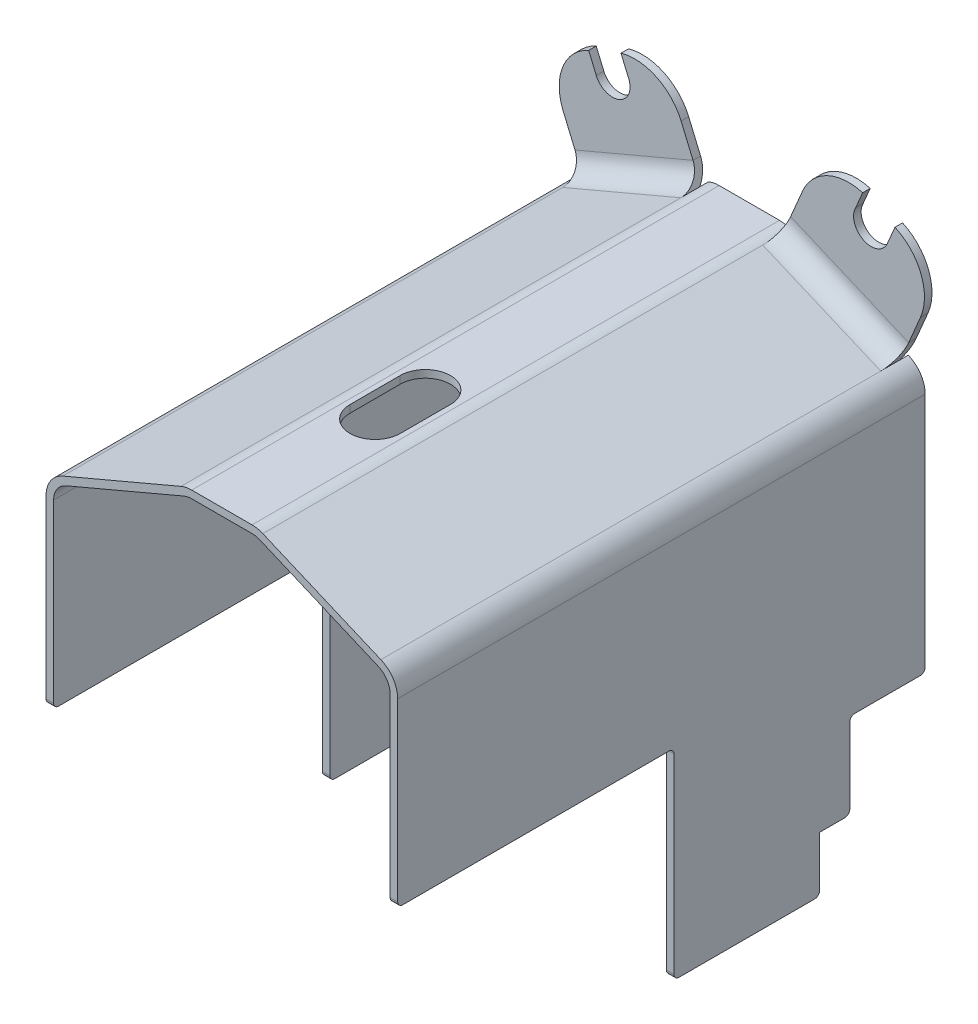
ISO-10303-21;
HEADER;
FILE_DESCRIPTION(('STEP AP214'),'2;1');
FILE_NAME('part.step','',(''),(''),'','','');
FILE_SCHEMA(('AUTOMOTIVE_DESIGN { 1 0 10303 214 1 1 1 1 }'));
ENDSEC;
DATA;
#1=APPLICATION_CONTEXT('core data for automotive mechanical design processes');
#2=APPLICATION_PROTOCOL_DEFINITION('international standard','automotive_design',2000,#1);
#3=PRODUCT_CONTEXT('',#1,'mechanical');
#4=PRODUCT('Part','Part','',(#3));
#5=PRODUCT_RELATED_PRODUCT_CATEGORY('part','',(#4));
#6=PRODUCT_DEFINITION_FORMATION('','',#4);
#7=PRODUCT_DEFINITION_CONTEXT('part definition',#1,'design');
#8=PRODUCT_DEFINITION('design','',#6,#7);
#9=PRODUCT_DEFINITION_SHAPE('','',#8);
#10=(LENGTH_UNIT() NAMED_UNIT(*) SI_UNIT(.MILLI.,.METRE.));
#11=(NAMED_UNIT(*) PLANE_ANGLE_UNIT() SI_UNIT($,.RADIAN.));
#12=(NAMED_UNIT(*) SI_UNIT($,.STERADIAN.) SOLID_ANGLE_UNIT());
#13=UNCERTAINTY_MEASURE_WITH_UNIT(LENGTH_MEASURE(1.E-05),#10,'distance_accuracy_value','');
#14=(GEOMETRIC_REPRESENTATION_CONTEXT(3) GLOBAL_UNCERTAINTY_ASSIGNED_CONTEXT((#13)) GLOBAL_UNIT_ASSIGNED_CONTEXT((#10,
#11,#12)) REPRESENTATION_CONTEXT('',''));
#15=CARTESIAN_POINT('',(0.,0.,0.));
#16=DIRECTION('',(0.,0.,1.));
#17=DIRECTION('',(1.,0.,0.));
#18=AXIS2_PLACEMENT_3D('',#15,#16,#17);
#19=CARTESIAN_POINT('',(-8.1508640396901,34.5627766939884,5.49999999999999));
#20=DIRECTION('',(-0.920504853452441,-0.390731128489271,0.));
#21=DIRECTION('',(0.390731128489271,-0.920504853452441,0.));
#22=AXIS2_PLACEMENT_3D('',#19,#20,#21);
#23=PLANE('',#22);
#24=DIRECTION('',(0.,0.,-1.));
#25=VECTOR('',#24,1.);
#26=CARTESIAN_POINT('',(-7.5647673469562,33.1820194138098,128.5));
#27=LINE('',#26,#25);
#28=CARTESIAN_POINT('',(-7.5647673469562,33.1820194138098,5.49999999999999));
#29=VERTEX_POINT('',#28);
#30=CARTESIAN_POINT('',(-7.5647673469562,33.1820194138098,0.));
#31=VERTEX_POINT('',#30);
#32=EDGE_CURVE('E1006',#29,#31,#27,.T.);
#33=ORIENTED_EDGE('',*,*,#32,.F.);
#34=CARTESIAN_POINT('',(-9.71378855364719,38.2447961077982,5.49999999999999));
#35=DIRECTION('',(-0.920504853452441,-0.390731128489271,0.));
#36=DIRECTION('',(0.390731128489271,-0.920504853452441,0.));
#37=AXIS2_PLACEMENT_3D('',#34,#35,#36);
#38=CIRCLE('',#37,5.5);
#39=CARTESIAN_POINT('',(-8.15086403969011,34.5627766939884,1.72508278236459));
#40=VERTEX_POINT('',#39);
#41=EDGE_CURVE('E897',#29,#40,#38,.F.);
#42=ORIENTED_EDGE('',*,*,#41,.T.);
#43=DIRECTION('',(0.,0.,-1.));
#44=VECTOR('',#43,1.);
#45=CARTESIAN_POINT('',(-8.1508640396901,34.5627766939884,5.49999999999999));
#46=LINE('',#45,#44);
#47=CARTESIAN_POINT('',(-8.15086403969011,34.5627766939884,0.));
#48=VERTEX_POINT('',#47);
#49=EDGE_CURVE('E899',#40,#48,#46,.T.);
#50=ORIENTED_EDGE('',*,*,#49,.T.);
#51=DIRECTION('',(0.390731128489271,-0.920504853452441,0.));
#52=VECTOR('',#51,1.);
#53=CARTESIAN_POINT('',(-8.15086403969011,34.5627766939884,0.));
#54=LINE('',#53,#52);
#55=EDGE_CURVE('E592',#48,#31,#54,.T.);
#56=ORIENTED_EDGE('',*,*,#55,.T.);
#57=EDGE_LOOP('',(#33,#42,#50,#56));
#58=FACE_BOUND('',#57,.T.);
#59=ADVANCED_FACE('F87',(#58),#23,.T.);
#60=CARTESIAN_POINT('',(-31.649021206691,24.5884007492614,0.));
#61=DIRECTION('',(0.920504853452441,0.390731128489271,0.));
#62=DIRECTION('',(-0.390731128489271,0.920504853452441,0.));
#63=AXIS2_PLACEMENT_3D('',#60,#61,#62);
#64=PLANE('',#63);
#65=DIRECTION('',(0.,0.,1.));
#66=VECTOR('',#65,1.);
#67=CARTESIAN_POINT('',(-31.649021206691,24.5884007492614,0.));
#68=LINE('',#67,#66);
#69=CARTESIAN_POINT('',(-31.649021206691,24.5884007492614,0.));
#70=VERTEX_POINT('',#69);
#71=CARTESIAN_POINT('',(-31.649021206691,24.5884007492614,1.72508278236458));
#72=VERTEX_POINT('',#71);
#73=EDGE_CURVE('E902',#70,#72,#68,.T.);
#74=ORIENTED_EDGE('',*,*,#73,.T.);
#75=CARTESIAN_POINT('',(-33.2119457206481,28.2704201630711,5.49999999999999));
#76=DIRECTION('',(-0.920504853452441,-0.390731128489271,0.));
#77=DIRECTION('',(0.390731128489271,-0.920504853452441,0.));
#78=AXIS2_PLACEMENT_3D('',#75,#76,#77);
#79=CIRCLE('',#78,5.5);
#80=CARTESIAN_POINT('',(-31.0629245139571,23.2076434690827,5.49999999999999));
#81=VERTEX_POINT('',#80);
#82=EDGE_CURVE('E607',#72,#81,#79,.T.);
#83=ORIENTED_EDGE('',*,*,#82,.T.);
#84=DIRECTION('',(0.,0.,-1.));
#85=VECTOR('',#84,1.);
#86=CARTESIAN_POINT('',(-31.0629245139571,23.2076434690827,128.5));
#87=LINE('',#86,#85);
#88=CARTESIAN_POINT('',(-31.0629245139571,23.2076434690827,0.));
#89=VERTEX_POINT('',#88);
#90=EDGE_CURVE('E1009',#81,#89,#87,.T.);
#91=ORIENTED_EDGE('',*,*,#90,.T.);
#92=DIRECTION('',(-0.390731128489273,0.920504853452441,0.));
#93=VECTOR('',#92,1.);
#94=CARTESIAN_POINT('',(-31.0629245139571,23.2076434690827,0.));
#95=LINE('',#94,#93);
#96=EDGE_CURVE('E600',#89,#70,#95,.T.);
#97=ORIENTED_EDGE('',*,*,#96,.T.);
#98=EDGE_LOOP('',(#74,#83,#91,#97));
#99=FACE_BOUND('',#98,.T.);
#100=ADVANCED_FACE('F1098',(#99),#64,.T.);
#101=CARTESIAN_POINT('',(-34.0860966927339,23.5539235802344,128.5));
#102=DIRECTION('',(-0.390731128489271,0.920504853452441,0.));
#103=DIRECTION('',(-0.920504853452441,-0.390731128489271,0.));
#104=AXIS2_PLACEMENT_3D('',#101,#102,#103);
#105=PLANE('',#104);
#106=DIRECTION('',(-0.920504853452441,-0.390731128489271,0.));
#107=VECTOR('',#106,1.);
#108=CARTESIAN_POINT('',(-34.0860966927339,23.5539235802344,105.));
#109=LINE('',#108,#107);
#110=CARTESIAN_POINT('',(-8.1508640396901,34.5627766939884,105.));
#111=VERTEX_POINT('',#110);
#112=CARTESIAN_POINT('',(-31.649021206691,24.5884007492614,105.));
#113=VERTEX_POINT('',#112);
#114=EDGE_CURVE('E1033',#111,#113,#109,.T.);
#115=ORIENTED_EDGE('',*,*,#114,.F.);
#116=DIRECTION('',(0.,0.,-1.));
#117=VECTOR('',#116,1.);
#118=CARTESIAN_POINT('',(-8.15086403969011,34.5627766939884,128.5));
#119=LINE('',#118,#117);
#120=CARTESIAN_POINT('',(-8.1508640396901,34.5627766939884,5.49999999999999));
#121=VERTEX_POINT('',#120);
#122=EDGE_CURVE('E569',#111,#121,#119,.T.);
#123=ORIENTED_EDGE('',*,*,#122,.T.);
#124=DIRECTION('',(-0.920504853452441,-0.390731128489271,0.));
#125=VECTOR('',#124,1.);
#126=CARTESIAN_POINT('',(-31.649021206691,24.5884007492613,5.49999999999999));
#127=LINE('',#126,#125);
#128=CARTESIAN_POINT('',(-31.649021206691,24.5884007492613,5.49999999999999));
#129=VERTEX_POINT('',#128);
#130=EDGE_CURVE('E888',#129,#121,#127,.F.);
#131=ORIENTED_EDGE('',*,*,#130,.F.);
#132=DIRECTION('',(0.,0.,-1.));
#133=VECTOR('',#132,1.);
#134=CARTESIAN_POINT('',(-31.649021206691,24.5884007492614,128.5));
#135=LINE('',#134,#133);
#136=EDGE_CURVE('E1024',#113,#129,#135,.T.);
#137=ORIENTED_EDGE('',*,*,#136,.F.);
#138=EDGE_LOOP('',(#115,#123,#131,#137));
#139=FACE_BOUND('',#138,.T.);
#140=ADVANCED_FACE('F1030',(#139),#105,.T.);
#141=CARTESIAN_POINT('',(-33.5,22.1731663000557,128.5));
#142=DIRECTION('',(-0.390731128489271,0.920504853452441,0.));
#143=DIRECTION('',(-0.920504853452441,-0.390731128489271,0.));
#144=AXIS2_PLACEMENT_3D('',#141,#142,#143);
#145=PLANE('',#144);
#146=CARTESIAN_POINT('',(-7.5647673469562,33.1820194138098,105.));
#147=VERTEX_POINT('',#146);
#148=EDGE_CURVE('E1007',#147,#29,#27,.T.);
#149=ORIENTED_EDGE('',*,*,#148,.F.);
#150=DIRECTION('',(-0.920504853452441,-0.390731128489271,0.));
#151=VECTOR('',#150,1.);
#152=CARTESIAN_POINT('',(-33.5,22.1731663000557,105.));
#153=LINE('',#152,#151);
#154=CARTESIAN_POINT('',(-31.0629245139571,23.2076434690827,105.));
#155=VERTEX_POINT('',#154);
#156=EDGE_CURVE('E2256',#147,#155,#153,.T.);
#157=ORIENTED_EDGE('',*,*,#156,.T.);
#158=EDGE_CURVE('E1010',#155,#81,#87,.T.);
#159=ORIENTED_EDGE('',*,*,#158,.T.);
#160=DIRECTION('',(-0.920504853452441,-0.390731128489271,0.));
#161=VECTOR('',#160,1.);
#162=CARTESIAN_POINT('',(-31.0629245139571,23.2076434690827,5.49999999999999));
#163=LINE('',#162,#161);
#164=EDGE_CURVE('E893',#81,#29,#163,.F.);
#165=ORIENTED_EDGE('',*,*,#164,.T.);
#166=EDGE_LOOP('',(#149,#157,#159,#165));
#167=FACE_BOUND('',#166,.T.);
#168=ADVANCED_FACE('F1151',(#167),#145,.F.);
#169=CARTESIAN_POINT('',(8.1508640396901,34.5627766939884,0.));
#170=DIRECTION('',(0.920504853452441,-0.390731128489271,0.));
#171=DIRECTION('',(0.390731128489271,0.920504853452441,0.));
#172=AXIS2_PLACEMENT_3D('',#169,#170,#171);
#173=PLANE('',#172);
#174=DIRECTION('',(0.,0.,1.));
#175=VECTOR('',#174,1.);
#176=CARTESIAN_POINT('',(8.1508640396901,34.5627766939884,0.));
#177=LINE('',#176,#175);
#178=CARTESIAN_POINT('',(8.1508640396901,34.5627766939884,0.));
#179=VERTEX_POINT('',#178);
#180=CARTESIAN_POINT('',(8.15086403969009,34.5627766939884,1.72508278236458));
#181=VERTEX_POINT('',#180);
#182=EDGE_CURVE('E950',#179,#181,#177,.T.);
#183=ORIENTED_EDGE('',*,*,#182,.T.);
#184=CARTESIAN_POINT('',(9.71378855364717,38.2447961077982,5.49999999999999));
#185=DIRECTION('',(-0.920504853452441,0.390731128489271,0.));
#186=DIRECTION('',(-0.390731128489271,-0.920504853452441,0.));
#187=AXIS2_PLACEMENT_3D('',#184,#185,#186);
#188=CIRCLE('',#187,5.5);
#189=CARTESIAN_POINT('',(7.56476734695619,33.1820194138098,5.49999999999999));
#190=VERTEX_POINT('',#189);
#191=EDGE_CURVE('E602',#181,#190,#188,.T.);
#192=ORIENTED_EDGE('',*,*,#191,.T.);
#193=DIRECTION('',(0.,0.,-1.));
#194=VECTOR('',#193,1.);
#195=CARTESIAN_POINT('',(7.56476734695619,33.1820194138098,128.5));
#196=LINE('',#195,#194);
#197=CARTESIAN_POINT('',(7.56476734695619,33.1820194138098,0.));
#198=VERTEX_POINT('',#197);
#199=EDGE_CURVE('E999',#190,#198,#196,.T.);
#200=ORIENTED_EDGE('',*,*,#199,.T.);
#201=DIRECTION('',(0.390731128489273,0.920504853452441,0.));
#202=VECTOR('',#201,1.);
#203=CARTESIAN_POINT('',(7.56476734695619,33.1820194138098,0.));
#204=LINE('',#203,#202);
#205=EDGE_CURVE('E590',#198,#179,#204,.T.);
#206=ORIENTED_EDGE('',*,*,#205,.T.);
#207=EDGE_LOOP('',(#183,#192,#200,#206));
#208=FACE_BOUND('',#207,.T.);
#209=ADVANCED_FACE('F1147',(#208),#173,.T.);
#210=CARTESIAN_POINT('',(31.649021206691,24.5884007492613,5.49999999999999));
#211=DIRECTION('',(-0.920504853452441,0.390731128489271,0.));
#212=DIRECTION('',(-0.390731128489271,-0.920504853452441,0.));
#213=AXIS2_PLACEMENT_3D('',#210,#211,#212);
#214=PLANE('',#213);
#215=DIRECTION('',(0.,0.,-1.));
#216=VECTOR('',#215,1.);
#217=CARTESIAN_POINT('',(31.0629245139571,23.2076434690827,128.5));
#218=LINE('',#217,#216);
#219=CARTESIAN_POINT('',(31.0629245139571,23.2076434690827,5.49999999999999));
#220=VERTEX_POINT('',#219);
#221=CARTESIAN_POINT('',(31.0629245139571,23.2076434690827,0.));
#222=VERTEX_POINT('',#221);
#223=EDGE_CURVE('E996',#220,#222,#218,.T.);
#224=ORIENTED_EDGE('',*,*,#223,.F.);
#225=CARTESIAN_POINT('',(33.2119457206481,28.2704201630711,5.49999999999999));
#226=DIRECTION('',(-0.920504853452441,0.390731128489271,0.));
#227=DIRECTION('',(-0.390731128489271,-0.920504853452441,0.));
#228=AXIS2_PLACEMENT_3D('',#225,#226,#227);
#229=CIRCLE('',#228,5.5);
#230=CARTESIAN_POINT('',(31.649021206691,24.5884007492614,1.72508278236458));
#231=VERTEX_POINT('',#230);
#232=EDGE_CURVE('E944',#220,#231,#229,.F.);
#233=ORIENTED_EDGE('',*,*,#232,.T.);
#234=DIRECTION('',(0.,0.,-1.));
#235=VECTOR('',#234,1.);
#236=CARTESIAN_POINT('',(31.649021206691,24.5884007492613,5.49999999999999));
#237=LINE('',#236,#235);
#238=CARTESIAN_POINT('',(31.649021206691,24.5884007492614,0.));
#239=VERTEX_POINT('',#238);
#240=EDGE_CURVE('E947',#231,#239,#237,.T.);
#241=ORIENTED_EDGE('',*,*,#240,.T.);
#242=DIRECTION('',(-0.390731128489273,-0.920504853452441,0.));
#243=VECTOR('',#242,1.);
#244=CARTESIAN_POINT('',(31.649021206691,24.5884007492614,0.));
#245=LINE('',#244,#243);
#246=EDGE_CURVE('E582',#239,#222,#245,.T.);
#247=ORIENTED_EDGE('',*,*,#246,.T.);
#248=EDGE_LOOP('',(#224,#233,#241,#247));
#249=FACE_BOUND('',#248,.T.);
#250=ADVANCED_FACE('F1143',(#249),#214,.T.);
#251=CARTESIAN_POINT('',(34.0860966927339,23.5539235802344,128.5));
#252=DIRECTION('',(0.390731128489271,0.920504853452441,0.));
#253=DIRECTION('',(-0.920504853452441,0.390731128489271,0.));
#254=AXIS2_PLACEMENT_3D('',#251,#252,#253);
#255=PLANE('',#254);
#256=DIRECTION('',(-0.920504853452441,0.390731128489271,0.));
#257=VECTOR('',#256,1.);
#258=CARTESIAN_POINT('',(34.0860966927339,23.5539235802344,105.));
#259=LINE('',#258,#257);
#260=CARTESIAN_POINT('',(31.649021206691,24.5884007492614,105.));
#261=VERTEX_POINT('',#260);
#262=CARTESIAN_POINT('',(8.1508640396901,34.5627766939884,105.));
#263=VERTEX_POINT('',#262);
#264=EDGE_CURVE('E543',#261,#263,#259,.T.);
#265=ORIENTED_EDGE('',*,*,#264,.F.);
#266=DIRECTION('',(0.,0.,-1.));
#267=VECTOR('',#266,1.);
#268=CARTESIAN_POINT('',(31.649021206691,24.5884007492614,128.5));
#269=LINE('',#268,#267);
#270=CARTESIAN_POINT('',(31.649021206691,24.5884007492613,5.49999999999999));
#271=VERTEX_POINT('',#270);
#272=EDGE_CURVE('E567',#261,#271,#269,.T.);
#273=ORIENTED_EDGE('',*,*,#272,.T.);
#274=DIRECTION('',(-0.920504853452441,0.390731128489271,0.));
#275=VECTOR('',#274,1.);
#276=CARTESIAN_POINT('',(8.15086403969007,34.5627766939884,5.49999999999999));
#277=LINE('',#276,#275);
#278=CARTESIAN_POINT('',(8.15086403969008,34.5627766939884,5.49999999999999));
#279=VERTEX_POINT('',#278);
#280=EDGE_CURVE('E935',#279,#271,#277,.F.);
#281=ORIENTED_EDGE('',*,*,#280,.F.);
#282=DIRECTION('',(0.,0.,-1.));
#283=VECTOR('',#282,1.);
#284=CARTESIAN_POINT('',(8.1508640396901,34.5627766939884,128.5));
#285=LINE('',#284,#283);
#286=EDGE_CURVE('E565',#263,#279,#285,.T.);
#287=ORIENTED_EDGE('',*,*,#286,.F.);
#288=EDGE_LOOP('',(#265,#273,#281,#287));
#289=FACE_BOUND('',#288,.T.);
#290=ADVANCED_FACE('F1146',(#289),#255,.T.);
#291=CARTESIAN_POINT('',(33.5,22.1731663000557,128.5));
#292=DIRECTION('',(0.390731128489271,0.920504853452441,0.));
#293=DIRECTION('',(-0.920504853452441,0.390731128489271,0.));
#294=AXIS2_PLACEMENT_3D('',#291,#292,#293);
#295=PLANE('',#294);
#296=CARTESIAN_POINT('',(31.0629245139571,23.2076434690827,105.));
#297=VERTEX_POINT('',#296);
#298=EDGE_CURVE('E997',#297,#220,#218,.T.);
#299=ORIENTED_EDGE('',*,*,#298,.F.);
#300=DIRECTION('',(-0.920504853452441,0.390731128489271,0.));
#301=VECTOR('',#300,1.);
#302=CARTESIAN_POINT('',(33.5,22.1731663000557,105.));
#303=LINE('',#302,#301);
#304=CARTESIAN_POINT('',(7.56476734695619,33.1820194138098,105.));
#305=VERTEX_POINT('',#304);
#306=EDGE_CURVE('E1261',#297,#305,#303,.T.);
#307=ORIENTED_EDGE('',*,*,#306,.T.);
#308=EDGE_CURVE('E1000',#305,#190,#196,.T.);
#309=ORIENTED_EDGE('',*,*,#308,.T.);
#310=DIRECTION('',(-0.920504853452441,0.390731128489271,0.));
#311=VECTOR('',#310,1.);
#312=CARTESIAN_POINT('',(7.56476734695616,33.1820194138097,5.49999999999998));
#313=LINE('',#312,#311);
#314=EDGE_CURVE('E940',#190,#220,#313,.F.);
#315=ORIENTED_EDGE('',*,*,#314,.T.);
#316=EDGE_LOOP('',(#299,#307,#309,#315));
#317=FACE_BOUND('',#316,.T.);
#318=ADVANCED_FACE('F1161',(#317),#295,.F.);
#319=CARTESIAN_POINT('',(-31.0629245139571,23.2076434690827,0.));
#320=DIRECTION('',(0.,0.,-1.));
#321=DIRECTION('',(-1.,0.,0.));
#322=AXIS2_PLACEMENT_3D('',#319,#320,#321);
#323=PLANE('',#322);
#324=ORIENTED_EDGE('',*,*,#96,.F.);
#325=CARTESIAN_POINT('',(-29.5,19.525624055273,0.));
#326=DIRECTION('',(0.,0.,1.));
#327=DIRECTION('',(1.,0.,0.));
#328=AXIS2_PLACEMENT_3D('',#325,#326,#327);
#329=CIRCLE('',#328,4.);
#330=CARTESIAN_POINT('',(-33.5,19.525624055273,0.));
#331=VERTEX_POINT('',#330);
#332=EDGE_CURVE('E979',#331,#89,#329,.F.);
#333=ORIENTED_EDGE('',*,*,#332,.F.);
#334=DIRECTION('',(1.,0.,0.));
#335=VECTOR('',#334,1.);
#336=CARTESIAN_POINT('',(-35.,19.525624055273,0.));
#337=LINE('',#336,#335);
#338=CARTESIAN_POINT('',(-35.,19.525624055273,0.));
#339=VERTEX_POINT('',#338);
#340=EDGE_CURVE('E597',#339,#331,#337,.T.);
#341=ORIENTED_EDGE('',*,*,#340,.F.);
#342=CARTESIAN_POINT('',(-29.5,19.525624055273,0.));
#343=DIRECTION('',(0.,0.,1.));
#344=DIRECTION('',(1.,0.,0.));
#345=AXIS2_PLACEMENT_3D('',#342,#343,#344);
#346=CIRCLE('',#345,5.5);
#347=EDGE_CURVE('E972',#339,#70,#346,.F.);
#348=ORIENTED_EDGE('',*,*,#347,.T.);
#349=EDGE_LOOP('',(#324,#333,#341,#348));
#350=FACE_BOUND('',#349,.T.);
#351=ADVANCED_FACE('F89',(#350),#323,.T.);
#352=CARTESIAN_POINT('',(-6.00184283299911,33.5,0.));
#353=DIRECTION('',(0.,0.,-1.));
#354=DIRECTION('',(-1.,0.,0.));
#355=AXIS2_PLACEMENT_3D('',#352,#353,#354);
#356=PLANE('',#355);
#357=DIRECTION('',(0.,1.,0.));
#358=VECTOR('',#357,1.);
#359=CARTESIAN_POINT('',(-6.00184283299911,33.5,0.));
#360=LINE('',#359,#358);
#361=CARTESIAN_POINT('',(-6.00184283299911,33.5,0.));
#362=VERTEX_POINT('',#361);
#363=CARTESIAN_POINT('',(-6.00184283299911,35.,0.));
#364=VERTEX_POINT('',#363);
#365=EDGE_CURVE('E594',#362,#364,#360,.T.);
#366=ORIENTED_EDGE('',*,*,#365,.F.);
#367=CARTESIAN_POINT('',(-6.00184283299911,29.5,0.));
#368=DIRECTION('',(0.,0.,1.));
#369=DIRECTION('',(1.,0.,0.));
#370=AXIS2_PLACEMENT_3D('',#367,#368,#369);
#371=CIRCLE('',#370,4.);
#372=EDGE_CURVE('E982',#31,#362,#371,.F.);
#373=ORIENTED_EDGE('',*,*,#372,.F.);
#374=ORIENTED_EDGE('',*,*,#55,.F.);
#375=CARTESIAN_POINT('',(-6.00184283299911,29.5,0.));
#376=DIRECTION('',(0.,0.,1.));
#377=DIRECTION('',(1.,0.,0.));
#378=AXIS2_PLACEMENT_3D('',#375,#376,#377);
#379=CIRCLE('',#378,5.5);
#380=EDGE_CURVE('E969',#48,#364,#379,.F.);
#381=ORIENTED_EDGE('',*,*,#380,.T.);
#382=EDGE_LOOP('',(#366,#373,#374,#381));
#383=FACE_BOUND('',#382,.T.);
#384=ADVANCED_FACE('F1235',(#383),#356,.T.);
#385=CARTESIAN_POINT('',(-8.15086403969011,34.5627766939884,0.));
#386=DIRECTION('',(0.,0.,-1.));
#387=DIRECTION('',(-1.,0.,0.));
#388=AXIS2_PLACEMENT_3D('',#385,#386,#387);
#389=PLANE('',#388);
#390=DIRECTION('',(1.,0.,0.));
#391=VECTOR('',#390,1.);
#392=CARTESIAN_POINT('',(-6.81565203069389,33.5,0.));
#393=LINE('',#392,#391);
#394=CARTESIAN_POINT('',(6.00184283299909,33.5,0.));
#395=VERTEX_POINT('',#394);
#396=EDGE_CURVE('E985',#362,#395,#393,.T.);
#397=ORIENTED_EDGE('',*,*,#396,.F.);
#398=ORIENTED_EDGE('',*,*,#365,.T.);
#399=DIRECTION('',(1.,0.,0.));
#400=VECTOR('',#399,1.);
#401=CARTESIAN_POINT('',(-6.81565203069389,35.,0.));
#402=LINE('',#401,#400);
#403=CARTESIAN_POINT('',(6.00184283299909,35.,0.));
#404=VERTEX_POINT('',#403);
#405=EDGE_CURVE('E967',#364,#404,#402,.T.);
#406=ORIENTED_EDGE('',*,*,#405,.T.);
#407=DIRECTION('',(0.,-1.,0.));
#408=VECTOR('',#407,1.);
#409=CARTESIAN_POINT('',(6.00184283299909,35.,0.));
#410=LINE('',#409,#408);
#411=EDGE_CURVE('E587',#404,#395,#410,.T.);
#412=ORIENTED_EDGE('',*,*,#411,.T.);
#413=EDGE_LOOP('',(#397,#398,#406,#412));
#414=FACE_BOUND('',#413,.T.);
#415=ADVANCED_FACE('F1232',(#414),#389,.T.);
#416=CARTESIAN_POINT('',(7.56476734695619,33.1820194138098,0.));
#417=DIRECTION('',(0.,0.,-1.));
#418=DIRECTION('',(-1.,0.,0.));
#419=AXIS2_PLACEMENT_3D('',#416,#417,#418);
#420=PLANE('',#419);
#421=ORIENTED_EDGE('',*,*,#205,.F.);
#422=CARTESIAN_POINT('',(6.00184283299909,29.5,0.));
#423=DIRECTION('',(0.,0.,1.));
#424=DIRECTION('',(1.,0.,0.));
#425=AXIS2_PLACEMENT_3D('',#422,#423,#424);
#426=CIRCLE('',#425,4.);
#427=EDGE_CURVE('E988',#395,#198,#426,.F.);
#428=ORIENTED_EDGE('',*,*,#427,.F.);
#429=ORIENTED_EDGE('',*,*,#411,.F.);
#430=CARTESIAN_POINT('',(6.00184283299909,29.5,0.));
#431=DIRECTION('',(0.,0.,1.));
#432=DIRECTION('',(1.,0.,0.));
#433=AXIS2_PLACEMENT_3D('',#430,#431,#432);
#434=CIRCLE('',#433,5.5);
#435=EDGE_CURVE('E563',#404,#179,#434,.F.);
#436=ORIENTED_EDGE('',*,*,#435,.T.);
#437=EDGE_LOOP('',(#421,#428,#429,#436));
#438=FACE_BOUND('',#437,.T.);
#439=ADVANCED_FACE('F1228',(#438),#420,.T.);
#440=CARTESIAN_POINT('',(33.5,19.525624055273,0.));
#441=DIRECTION('',(0.,0.,-1.));
#442=DIRECTION('',(-1.,0.,0.));
#443=AXIS2_PLACEMENT_3D('',#440,#441,#442);
#444=PLANE('',#443);
#445=DIRECTION('',(1.,0.,0.));
#446=VECTOR('',#445,1.);
#447=CARTESIAN_POINT('',(33.5,19.525624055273,0.));
#448=LINE('',#447,#446);
#449=CARTESIAN_POINT('',(33.5,19.525624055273,0.));
#450=VERTEX_POINT('',#449);
#451=CARTESIAN_POINT('',(35.,19.525624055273,0.));
#452=VERTEX_POINT('',#451);
#453=EDGE_CURVE('E584',#450,#452,#448,.T.);
#454=ORIENTED_EDGE('',*,*,#453,.F.);
#455=CARTESIAN_POINT('',(29.5,19.525624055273,0.));
#456=DIRECTION('',(0.,0.,1.));
#457=DIRECTION('',(1.,0.,0.));
#458=AXIS2_PLACEMENT_3D('',#455,#456,#457);
#459=CIRCLE('',#458,4.);
#460=EDGE_CURVE('E991',#222,#450,#459,.F.);
#461=ORIENTED_EDGE('',*,*,#460,.F.);
#462=ORIENTED_EDGE('',*,*,#246,.F.);
#463=CARTESIAN_POINT('',(29.5,19.525624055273,0.));
#464=DIRECTION('',(0.,0.,1.));
#465=DIRECTION('',(1.,0.,0.));
#466=AXIS2_PLACEMENT_3D('',#463,#464,#465);
#467=CIRCLE('',#466,5.5);
#468=EDGE_CURVE('E963',#239,#452,#467,.F.);
#469=ORIENTED_EDGE('',*,*,#468,.T.);
#470=EDGE_LOOP('',(#454,#461,#462,#469));
#471=FACE_BOUND('',#470,.T.);
#472=ADVANCED_FACE('F1224',(#471),#444,.T.);
#473=CARTESIAN_POINT('',(31.649021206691,24.5884007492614,0.));
#474=DIRECTION('',(0.,0.,-1.));
#475=DIRECTION('',(-1.,0.,0.));
#476=AXIS2_PLACEMENT_3D('',#473,#474,#475);
#477=PLANE('',#476);
#478=DIRECTION('',(0.,-1.,0.));
#479=VECTOR('',#478,1.);
#480=CARTESIAN_POINT('',(35.,22.1731663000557,0.));
#481=LINE('',#480,#479);
#482=CARTESIAN_POINT('',(35.,-27.5,0.));
#483=VERTEX_POINT('',#482);
#484=EDGE_CURVE('E960',#452,#483,#481,.T.);
#485=ORIENTED_EDGE('',*,*,#484,.T.);
#486=DIRECTION('',(1.,0.,0.));
#487=VECTOR('',#486,1.);
#488=CARTESIAN_POINT('',(33.5,-27.5,0.));
#489=LINE('',#488,#487);
#490=CARTESIAN_POINT('',(33.5,-27.5,0.));
#491=VERTEX_POINT('',#490);
#492=EDGE_CURVE('E756',#483,#491,#489,.F.);
#493=ORIENTED_EDGE('',*,*,#492,.T.);
#494=DIRECTION('',(0.,-1.,0.));
#495=VECTOR('',#494,1.);
#496=CARTESIAN_POINT('',(33.5,22.1731663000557,0.));
#497=LINE('',#496,#495);
#498=EDGE_CURVE('E953',#450,#491,#497,.T.);
#499=ORIENTED_EDGE('',*,*,#498,.F.);
#500=ORIENTED_EDGE('',*,*,#453,.T.);
#501=EDGE_LOOP('',(#485,#493,#499,#500));
#502=FACE_BOUND('',#501,.T.);
#503=ADVANCED_FACE('F1221',(#502),#477,.T.);
#504=CARTESIAN_POINT('',(33.5,22.1731663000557,128.5));
#505=DIRECTION('',(1.,0.,0.));
#506=DIRECTION('',(0.,1.,0.));
#507=AXIS2_PLACEMENT_3D('',#504,#505,#506);
#508=PLANE('',#507);
#509=DIRECTION('',(0.,0.,1.));
#510=VECTOR('',#509,1.);
#511=CARTESIAN_POINT('',(33.5,-16.5,128.5));
#512=LINE('',#511,#510);
#513=CARTESIAN_POINT('',(33.5,-16.5,51.));
#514=VERTEX_POINT('',#513);
#515=CARTESIAN_POINT('',(33.5,-16.5,104.));
#516=VERTEX_POINT('',#515);
#517=EDGE_CURVE('E1336',#514,#516,#512,.T.);
#518=ORIENTED_EDGE('',*,*,#517,.T.);
#519=CARTESIAN_POINT('',(33.5,-15.5,104.));
#520=DIRECTION('',(1.,0.,0.));
#521=DIRECTION('',(0.,1.,0.));
#522=AXIS2_PLACEMENT_3D('',#519,#520,#521);
#523=CIRCLE('',#522,1.);
#524=CARTESIAN_POINT('',(33.5,-15.5,105.));
#525=VERTEX_POINT('',#524);
#526=EDGE_CURVE('E664',#516,#525,#523,.F.);
#527=ORIENTED_EDGE('',*,*,#526,.T.);
#528=DIRECTION('',(0.,1.,0.));
#529=VECTOR('',#528,1.);
#530=CARTESIAN_POINT('',(33.5,22.1731663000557,105.));
#531=LINE('',#530,#529);
#532=CARTESIAN_POINT('',(33.5,19.525624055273,105.));
#533=VERTEX_POINT('',#532);
#534=EDGE_CURVE('E1272',#525,#533,#531,.T.);
#535=ORIENTED_EDGE('',*,*,#534,.T.);
#536=DIRECTION('',(0.,0.,-1.));
#537=VECTOR('',#536,1.);
#538=CARTESIAN_POINT('',(33.5,19.525624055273,128.5));
#539=LINE('',#538,#537);
#540=EDGE_CURVE('E994',#533,#450,#539,.T.);
#541=ORIENTED_EDGE('',*,*,#540,.T.);
#542=ORIENTED_EDGE('',*,*,#498,.T.);
#543=CARTESIAN_POINT('',(33.5,-27.5,1.));
#544=DIRECTION('',(1.,0.,0.));
#545=DIRECTION('',(0.,1.,0.));
#546=AXIS2_PLACEMENT_3D('',#543,#544,#545);
#547=CIRCLE('',#546,1.);
#548=CARTESIAN_POINT('',(33.5,-28.5,1.));
#549=VERTEX_POINT('',#548);
#550=EDGE_CURVE('E656',#491,#549,#547,.F.);
#551=ORIENTED_EDGE('',*,*,#550,.T.);
#552=DIRECTION('',(0.,0.,1.));
#553=VECTOR('',#552,1.);
#554=CARTESIAN_POINT('',(33.5,-28.5,128.5));
#555=LINE('',#554,#553);
#556=CARTESIAN_POINT('',(33.5,-28.5,14.));
#557=VERTEX_POINT('',#556);
#558=EDGE_CURVE('E796',#549,#557,#555,.T.);
#559=ORIENTED_EDGE('',*,*,#558,.T.);
#560=CARTESIAN_POINT('',(33.5,-29.5,14.));
#561=DIRECTION('',(1.,0.,0.));
#562=DIRECTION('',(0.,1.,0.));
#563=AXIS2_PLACEMENT_3D('',#560,#561,#562);
#564=CIRCLE('',#563,1.);
#565=CARTESIAN_POINT('',(33.5,-29.5,15.));
#566=VERTEX_POINT('',#565);
#567=EDGE_CURVE('E15',#557,#566,#564,.T.);
#568=ORIENTED_EDGE('',*,*,#567,.T.);
#569=DIRECTION('',(0.,-1.,0.));
#570=VECTOR('',#569,1.);
#571=CARTESIAN_POINT('',(33.5,22.1731663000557,15.));
#572=LINE('',#571,#570);
#573=CARTESIAN_POINT('',(33.5,-44.5,15.));
#574=VERTEX_POINT('',#573);
#575=EDGE_CURVE('E795',#566,#574,#572,.T.);
#576=ORIENTED_EDGE('',*,*,#575,.T.);
#577=CARTESIAN_POINT('',(33.5,-44.5,16.));
#578=DIRECTION('',(1.,0.,0.));
#579=DIRECTION('',(0.,1.,0.));
#580=AXIS2_PLACEMENT_3D('',#577,#578,#579);
#581=CIRCLE('',#580,1.);
#582=CARTESIAN_POINT('',(33.5,-45.5,16.));
#583=VERTEX_POINT('',#582);
#584=EDGE_CURVE('E660',#574,#583,#581,.F.);
#585=ORIENTED_EDGE('',*,*,#584,.T.);
#586=DIRECTION('',(0.,0.,1.));
#587=VECTOR('',#586,1.);
#588=CARTESIAN_POINT('',(33.5,-45.5,128.5));
#589=LINE('',#588,#587);
#590=CARTESIAN_POINT('',(33.5,-45.5,21.));
#591=VERTEX_POINT('',#590);
#592=EDGE_CURVE('E1297',#583,#591,#589,.T.);
#593=ORIENTED_EDGE('',*,*,#592,.T.);
#594=DIRECTION('',(0.,-1.,0.));
#595=VECTOR('',#594,1.);
#596=CARTESIAN_POINT('',(33.5,22.1731663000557,21.));
#597=LINE('',#596,#595);
#598=CARTESIAN_POINT('',(33.5,-55.5,21.));
#599=VERTEX_POINT('',#598);
#600=EDGE_CURVE('E1301',#591,#599,#597,.T.);
#601=ORIENTED_EDGE('',*,*,#600,.T.);
#602=CARTESIAN_POINT('',(33.5,-55.5,22.));
#603=DIRECTION('',(1.,0.,0.));
#604=DIRECTION('',(0.,1.,0.));
#605=AXIS2_PLACEMENT_3D('',#602,#603,#604);
#606=CIRCLE('',#605,1.);
#607=CARTESIAN_POINT('',(33.5,-56.5,22.));
#608=VERTEX_POINT('',#607);
#609=EDGE_CURVE('E662',#599,#608,#606,.F.);
#610=ORIENTED_EDGE('',*,*,#609,.T.);
#611=DIRECTION('',(0.,0.,-1.));
#612=VECTOR('',#611,1.);
#613=CARTESIAN_POINT('',(33.5,-56.5,128.5));
#614=LINE('',#613,#612);
#615=CARTESIAN_POINT('',(33.5,-56.5,49.));
#616=VERTEX_POINT('',#615);
#617=EDGE_CURVE('E579',#616,#608,#614,.T.);
#618=ORIENTED_EDGE('',*,*,#617,.F.);
#619=CARTESIAN_POINT('',(33.5,-55.5,49.));
#620=DIRECTION('',(1.,0.,0.));
#621=DIRECTION('',(0.,1.,0.));
#622=AXIS2_PLACEMENT_3D('',#619,#620,#621);
#623=CIRCLE('',#622,1.);
#624=CARTESIAN_POINT('',(33.5,-55.5,50.));
#625=VERTEX_POINT('',#624);
#626=EDGE_CURVE('E658',#616,#625,#623,.F.);
#627=ORIENTED_EDGE('',*,*,#626,.T.);
#628=DIRECTION('',(0.,1.,0.));
#629=VECTOR('',#628,1.);
#630=CARTESIAN_POINT('',(33.5,22.1731663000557,50.));
#631=LINE('',#630,#629);
#632=CARTESIAN_POINT('',(33.5,-17.5,50.));
#633=VERTEX_POINT('',#632);
#634=EDGE_CURVE('E786',#625,#633,#631,.T.);
#635=ORIENTED_EDGE('',*,*,#634,.T.);
#636=CARTESIAN_POINT('',(33.5,-17.5,51.));
#637=DIRECTION('',(1.,0.,0.));
#638=DIRECTION('',(0.,1.,0.));
#639=AXIS2_PLACEMENT_3D('',#636,#637,#638);
#640=CIRCLE('',#639,1.);
#641=EDGE_CURVE('E768',#633,#514,#640,.T.);
#642=ORIENTED_EDGE('',*,*,#641,.T.);
#643=EDGE_LOOP('',(#518,#527,#535,#541,#542,#551,#559,#568,#576,#585,#593,#601,#610,#618,#627,
#635,#642));
#644=FACE_BOUND('',#643,.T.);
#645=ADVANCED_FACE('F794',(#644),#508,.F.);
#646=CARTESIAN_POINT('',(35.,-56.5,128.5));
#647=DIRECTION('',(0.,-1.,0.));
#648=DIRECTION('',(0.,0.,-1.));
#649=AXIS2_PLACEMENT_3D('',#646,#647,#648);
#650=PLANE('',#649);
#651=ORIENTED_EDGE('',*,*,#617,.T.);
#652=DIRECTION('',(1.,0.,0.));
#653=VECTOR('',#652,1.);
#654=CARTESIAN_POINT('',(35.,-56.5,22.));
#655=LINE('',#654,#653);
#656=CARTESIAN_POINT('',(35.,-56.5,22.));
#657=VERTEX_POINT('',#656);
#658=EDGE_CURVE('E707',#608,#657,#655,.T.);
#659=ORIENTED_EDGE('',*,*,#658,.T.);
#660=DIRECTION('',(0.,0.,-1.));
#661=VECTOR('',#660,1.);
#662=CARTESIAN_POINT('',(35.,-56.5,128.5));
#663=LINE('',#662,#661);
#664=CARTESIAN_POINT('',(35.,-56.5,49.));
#665=VERTEX_POINT('',#664);
#666=EDGE_CURVE('E576',#665,#657,#663,.T.);
#667=ORIENTED_EDGE('',*,*,#666,.F.);
#668=DIRECTION('',(1.,0.,0.));
#669=VECTOR('',#668,1.);
#670=CARTESIAN_POINT('',(33.5,-56.5,49.));
#671=LINE('',#670,#669);
#672=EDGE_CURVE('E705',#665,#616,#671,.F.);
#673=ORIENTED_EDGE('',*,*,#672,.T.);
#674=EDGE_LOOP('',(#651,#659,#667,#673));
#675=FACE_BOUND('',#674,.T.);
#676=ADVANCED_FACE('F1215',(#675),#650,.T.);
#677=CARTESIAN_POINT('',(35.,22.1731663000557,128.5));
#678=DIRECTION('',(1.,0.,0.));
#679=DIRECTION('',(0.,1.,0.));
#680=AXIS2_PLACEMENT_3D('',#677,#678,#679);
#681=PLANE('',#680);
#682=DIRECTION('',(0.,1.,0.));
#683=VECTOR('',#682,1.);
#684=CARTESIAN_POINT('',(35.,-56.5,105.));
#685=LINE('',#684,#683);
#686=CARTESIAN_POINT('',(35.,-15.5,105.));
#687=VERTEX_POINT('',#686);
#688=CARTESIAN_POINT('',(35.,19.525624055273,105.));
#689=VERTEX_POINT('',#688);
#690=EDGE_CURVE('E557',#687,#689,#685,.T.);
#691=ORIENTED_EDGE('',*,*,#690,.F.);
#692=CARTESIAN_POINT('',(35.,-15.5,104.));
#693=DIRECTION('',(1.,0.,0.));
#694=DIRECTION('',(0.,1.,0.));
#695=AXIS2_PLACEMENT_3D('',#692,#693,#694);
#696=CIRCLE('',#695,1.);
#697=CARTESIAN_POINT('',(35.,-16.5,104.));
#698=VERTEX_POINT('',#697);
#699=EDGE_CURVE('E678',#687,#698,#696,.T.);
#700=ORIENTED_EDGE('',*,*,#699,.T.);
#701=DIRECTION('',(0.,0.,1.));
#702=VECTOR('',#701,1.);
#703=CARTESIAN_POINT('',(35.,-16.5,128.5));
#704=LINE('',#703,#702);
#705=CARTESIAN_POINT('',(35.,-16.5,51.));
#706=VERTEX_POINT('',#705);
#707=EDGE_CURVE('E1327',#706,#698,#704,.T.);
#708=ORIENTED_EDGE('',*,*,#707,.F.);
#709=CARTESIAN_POINT('',(35.,-17.5,51.));
#710=DIRECTION('',(1.,0.,0.));
#711=DIRECTION('',(0.,1.,0.));
#712=AXIS2_PLACEMENT_3D('',#709,#710,#711);
#713=CIRCLE('',#712,1.);
#714=CARTESIAN_POINT('',(35.,-17.5,50.));
#715=VERTEX_POINT('',#714);
#716=EDGE_CURVE('E766',#706,#715,#713,.F.);
#717=ORIENTED_EDGE('',*,*,#716,.T.);
#718=DIRECTION('',(0.,1.,0.));
#719=VECTOR('',#718,1.);
#720=CARTESIAN_POINT('',(35.,-56.5,50.));
#721=LINE('',#720,#719);
#722=CARTESIAN_POINT('',(35.,-55.5,50.));
#723=VERTEX_POINT('',#722);
#724=EDGE_CURVE('E1318',#723,#715,#721,.T.);
#725=ORIENTED_EDGE('',*,*,#724,.F.);
#726=CARTESIAN_POINT('',(35.,-55.5,49.));
#727=DIRECTION('',(1.,0.,0.));
#728=DIRECTION('',(0.,1.,0.));
#729=AXIS2_PLACEMENT_3D('',#726,#727,#728);
#730=CIRCLE('',#729,1.);
#731=EDGE_CURVE('E672',#723,#665,#730,.T.);
#732=ORIENTED_EDGE('',*,*,#731,.T.);
#733=ORIENTED_EDGE('',*,*,#666,.T.);
#734=CARTESIAN_POINT('',(35.,-55.5,22.));
#735=DIRECTION('',(1.,0.,0.));
#736=DIRECTION('',(0.,1.,0.));
#737=AXIS2_PLACEMENT_3D('',#734,#735,#736);
#738=CIRCLE('',#737,1.);
#739=CARTESIAN_POINT('',(35.,-55.5,21.));
#740=VERTEX_POINT('',#739);
#741=EDGE_CURVE('E676',#657,#740,#738,.T.);
#742=ORIENTED_EDGE('',*,*,#741,.T.);
#743=DIRECTION('',(0.,-1.,0.));
#744=VECTOR('',#743,1.);
#745=CARTESIAN_POINT('',(35.,-56.5,21.));
#746=LINE('',#745,#744);
#747=CARTESIAN_POINT('',(35.,-45.5,21.));
#748=VERTEX_POINT('',#747);
#749=EDGE_CURVE('E1284',#748,#740,#746,.T.);
#750=ORIENTED_EDGE('',*,*,#749,.F.);
#751=DIRECTION('',(0.,0.,1.));
#752=VECTOR('',#751,1.);
#753=CARTESIAN_POINT('',(35.,-45.5,15.));
#754=LINE('',#753,#752);
#755=CARTESIAN_POINT('',(35.,-45.5,16.));
#756=VERTEX_POINT('',#755);
#757=EDGE_CURVE('E1282',#756,#748,#754,.T.);
#758=ORIENTED_EDGE('',*,*,#757,.F.);
#759=CARTESIAN_POINT('',(35.,-44.5,16.));
#760=DIRECTION('',(1.,0.,0.));
#761=DIRECTION('',(0.,1.,0.));
#762=AXIS2_PLACEMENT_3D('',#759,#760,#761);
#763=CIRCLE('',#762,1.);
#764=CARTESIAN_POINT('',(35.,-44.5,15.));
#765=VERTEX_POINT('',#764);
#766=EDGE_CURVE('E674',#756,#765,#763,.T.);
#767=ORIENTED_EDGE('',*,*,#766,.T.);
#768=DIRECTION('',(0.,-1.,0.));
#769=VECTOR('',#768,1.);
#770=CARTESIAN_POINT('',(35.,-56.5,15.));
#771=LINE('',#770,#769);
#772=CARTESIAN_POINT('',(35.,-29.5,15.));
#773=VERTEX_POINT('',#772);
#774=EDGE_CURVE('E777',#773,#765,#771,.T.);
#775=ORIENTED_EDGE('',*,*,#774,.F.);
#776=CARTESIAN_POINT('',(35.,-29.5,14.));
#777=DIRECTION('',(1.,0.,0.));
#778=DIRECTION('',(0.,1.,0.));
#779=AXIS2_PLACEMENT_3D('',#776,#777,#778);
#780=CIRCLE('',#779,1.);
#781=CARTESIAN_POINT('',(35.,-28.5,14.));
#782=VERTEX_POINT('',#781);
#783=EDGE_CURVE('E95',#773,#782,#780,.F.);
#784=ORIENTED_EDGE('',*,*,#783,.T.);
#785=DIRECTION('',(0.,0.,1.));
#786=VECTOR('',#785,1.);
#787=CARTESIAN_POINT('',(35.,-28.5,0.));
#788=LINE('',#787,#786);
#789=CARTESIAN_POINT('',(35.,-28.5,1.));
#790=VERTEX_POINT('',#789);
#791=EDGE_CURVE('E775',#790,#782,#788,.T.);
#792=ORIENTED_EDGE('',*,*,#791,.F.);
#793=CARTESIAN_POINT('',(35.,-27.5,1.));
#794=DIRECTION('',(1.,0.,0.));
#795=DIRECTION('',(0.,1.,0.));
#796=AXIS2_PLACEMENT_3D('',#793,#794,#795);
#797=CIRCLE('',#796,1.);
#798=EDGE_CURVE('E670',#790,#483,#797,.T.);
#799=ORIENTED_EDGE('',*,*,#798,.T.);
#800=ORIENTED_EDGE('',*,*,#484,.F.);
#801=DIRECTION('',(0.,0.,-1.));
#802=VECTOR('',#801,1.);
#803=CARTESIAN_POINT('',(35.,19.525624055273,128.5));
#804=LINE('',#803,#802);
#805=EDGE_CURVE('E574',#689,#452,#804,.T.);
#806=ORIENTED_EDGE('',*,*,#805,.F.);
#807=EDGE_LOOP('',(#691,#700,#708,#717,#725,#732,#733,#742,#750,#758,#767,#775,#784,#792,#799,
#800,#806));
#808=FACE_BOUND('',#807,.T.);
#809=ADVANCED_FACE('F774',(#808),#681,.T.);
#810=CARTESIAN_POINT('',(29.5,19.525624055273,128.5));
#811=DIRECTION('',(0.,0.,-1.));
#812=DIRECTION('',(-1.,0.,0.));
#813=AXIS2_PLACEMENT_3D('',#810,#811,#812);
#814=CYLINDRICAL_SURFACE('',#813,5.5);
#815=CARTESIAN_POINT('',(29.5,19.525624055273,105.));
#816=DIRECTION('',(0.,0.,-1.));
#817=DIRECTION('',(-1.,0.,0.));
#818=AXIS2_PLACEMENT_3D('',#815,#816,#817);
#819=CIRCLE('',#818,5.5);
#820=EDGE_CURVE('E1280',#689,#261,#819,.F.);
#821=ORIENTED_EDGE('',*,*,#820,.F.);
#822=ORIENTED_EDGE('',*,*,#805,.T.);
#823=ORIENTED_EDGE('',*,*,#468,.F.);
#824=ORIENTED_EDGE('',*,*,#240,.F.);
#825=EDGE_CURVE('E955',#271,#231,#237,.T.);
#826=ORIENTED_EDGE('',*,*,#825,.F.);
#827=ORIENTED_EDGE('',*,*,#272,.F.);
#828=EDGE_LOOP('',(#821,#822,#823,#824,#826,#827));
#829=FACE_BOUND('',#828,.T.);
#830=ADVANCED_FACE('F1206',(#829),#814,.T.);
#831=CARTESIAN_POINT('',(6.00184283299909,29.5,128.5));
#832=DIRECTION('',(0.,0.,-1.));
#833=DIRECTION('',(-1.,0.,0.));
#834=AXIS2_PLACEMENT_3D('',#831,#832,#833);
#835=CYLINDRICAL_SURFACE('',#834,5.5);
#836=CARTESIAN_POINT('',(6.00184283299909,29.5,105.));
#837=DIRECTION('',(0.,0.,-1.));
#838=DIRECTION('',(-1.,0.,0.));
#839=AXIS2_PLACEMENT_3D('',#836,#837,#838);
#840=CIRCLE('',#839,5.5);
#841=CARTESIAN_POINT('',(6.00184283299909,35.,105.));
#842=VERTEX_POINT('',#841);
#843=EDGE_CURVE('E536',#263,#842,#840,.F.);
#844=ORIENTED_EDGE('',*,*,#843,.F.);
#845=ORIENTED_EDGE('',*,*,#286,.T.);
#846=EDGE_CURVE('E954',#181,#279,#177,.T.);
#847=ORIENTED_EDGE('',*,*,#846,.F.);
#848=ORIENTED_EDGE('',*,*,#182,.F.);
#849=ORIENTED_EDGE('',*,*,#435,.F.);
#850=DIRECTION('',(0.,0.,-1.));
#851=VECTOR('',#850,1.);
#852=CARTESIAN_POINT('',(6.00184283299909,35.,128.5));
#853=LINE('',#852,#851);
#854=EDGE_CURVE('E554',#842,#404,#853,.T.);
#855=ORIENTED_EDGE('',*,*,#854,.F.);
#856=EDGE_LOOP('',(#844,#845,#847,#848,#849,#855));
#857=FACE_BOUND('',#856,.T.);
#858=ADVANCED_FACE('F560',(#857),#835,.T.);
#859=CARTESIAN_POINT('',(-6.81565203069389,35.,128.5));
#860=DIRECTION('',(0.,1.,0.));
#861=DIRECTION('',(0.,0.,1.));
#862=AXIS2_PLACEMENT_3D('',#859,#860,#861);
#863=PLANE('',#862);
#864=DIRECTION('',(-1.,0.,0.));
#865=VECTOR('',#864,1.);
#866=CARTESIAN_POINT('',(35.,35.,105.));
#867=LINE('',#866,#865);
#868=CARTESIAN_POINT('',(-6.00184283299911,35.,105.));
#869=VERTEX_POINT('',#868);
#870=EDGE_CURVE('E540',#842,#869,#867,.T.);
#871=ORIENTED_EDGE('',*,*,#870,.F.);
#872=ORIENTED_EDGE('',*,*,#854,.T.);
#873=ORIENTED_EDGE('',*,*,#405,.F.);
#874=DIRECTION('',(0.,0.,-1.));
#875=VECTOR('',#874,1.);
#876=CARTESIAN_POINT('',(-6.00184283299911,35.,128.5));
#877=LINE('',#876,#875);
#878=EDGE_CURVE('E556',#869,#364,#877,.T.);
#879=ORIENTED_EDGE('',*,*,#878,.F.);
#880=EDGE_LOOP('',(#871,#872,#873,#879));
#881=FACE_BOUND('',#880,.T.);
#882=CARTESIAN_POINT('',(0.,35.,74.5));
#883=DIRECTION('',(0.,1.,0.));
#884=DIRECTION('',(-1.,0.,0.));
#885=AXIS2_PLACEMENT_3D('',#882,#883,#884);
#886=CIRCLE('',#885,4.99999999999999);
#887=CARTESIAN_POINT('',(-4.99999999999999,35.,74.5));
#888=VERTEX_POINT('',#887);
#889=CARTESIAN_POINT('',(4.99999999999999,35.,74.5));
#890=VERTEX_POINT('',#889);
#891=EDGE_CURVE('E1304',#888,#890,#886,.T.);
#892=ORIENTED_EDGE('',*,*,#891,.F.);
#893=DIRECTION('',(0.,0.,1.));
#894=VECTOR('',#893,1.);
#895=CARTESIAN_POINT('',(-4.99999999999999,35.,74.5));
#896=LINE('',#895,#894);
#897=CARTESIAN_POINT('',(-5.,35.,64.5));
#898=VERTEX_POINT('',#897);
#899=EDGE_CURVE('E1312',#898,#888,#896,.T.);
#900=ORIENTED_EDGE('',*,*,#899,.F.);
#901=CARTESIAN_POINT('',(0.,35.,64.5));
#902=DIRECTION('',(0.,1.,0.));
#903=DIRECTION('',(-1.,0.,0.));
#904=AXIS2_PLACEMENT_3D('',#901,#902,#903);
#905=CIRCLE('',#904,4.99999999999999);
#906=CARTESIAN_POINT('',(4.99999999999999,35.,64.5));
#907=VERTEX_POINT('',#906);
#908=EDGE_CURVE('E1309',#907,#898,#905,.T.);
#909=ORIENTED_EDGE('',*,*,#908,.F.);
#910=DIRECTION('',(0.,0.,-1.));
#911=VECTOR('',#910,1.);
#912=CARTESIAN_POINT('',(4.99999999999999,35.,74.5));
#913=LINE('',#912,#911);
#914=EDGE_CURVE('E1306',#890,#907,#913,.T.);
#915=ORIENTED_EDGE('',*,*,#914,.F.);
#916=EDGE_LOOP('',(#892,#900,#909,#915));
#917=FACE_BOUND('',#916,.T.);
#918=ADVANCED_FACE('F551',(#881,#917),#863,.T.);
#919=CARTESIAN_POINT('',(-6.00184283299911,29.5,128.5));
#920=DIRECTION('',(0.,0.,-1.));
#921=DIRECTION('',(-1.,0.,0.));
#922=AXIS2_PLACEMENT_3D('',#919,#920,#921);
#923=CYLINDRICAL_SURFACE('',#922,5.5);
#924=CARTESIAN_POINT('',(-6.00184283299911,29.5,105.));
#925=DIRECTION('',(0.,0.,-1.));
#926=DIRECTION('',(-1.,0.,0.));
#927=AXIS2_PLACEMENT_3D('',#924,#925,#926);
#928=CIRCLE('',#927,5.5);
#929=EDGE_CURVE('E547',#869,#111,#928,.F.);
#930=ORIENTED_EDGE('',*,*,#929,.F.);
#931=ORIENTED_EDGE('',*,*,#878,.T.);
#932=ORIENTED_EDGE('',*,*,#380,.F.);
#933=ORIENTED_EDGE('',*,*,#49,.F.);
#934=EDGE_CURVE('E907',#121,#40,#46,.T.);
#935=ORIENTED_EDGE('',*,*,#934,.F.);
#936=ORIENTED_EDGE('',*,*,#122,.F.);
#937=EDGE_LOOP('',(#930,#931,#932,#933,#935,#936));
#938=FACE_BOUND('',#937,.T.);
#939=ADVANCED_FACE('F1036',(#938),#923,.T.);
#940=CARTESIAN_POINT('',(-29.5,19.525624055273,128.5));
#941=DIRECTION('',(0.,0.,-1.));
#942=DIRECTION('',(-1.,0.,0.));
#943=AXIS2_PLACEMENT_3D('',#940,#941,#942);
#944=CYLINDRICAL_SURFACE('',#943,5.5);
#945=CARTESIAN_POINT('',(-29.5,19.525624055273,105.));
#946=DIRECTION('',(0.,0.,-1.));
#947=DIRECTION('',(-1.,0.,0.));
#948=AXIS2_PLACEMENT_3D('',#945,#946,#947);
#949=CIRCLE('',#948,5.5);
#950=CARTESIAN_POINT('',(-35.,19.5256240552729,105.));
#951=VERTEX_POINT('',#950);
#952=EDGE_CURVE('E1274',#113,#951,#949,.F.);
#953=ORIENTED_EDGE('',*,*,#952,.F.);
#954=ORIENTED_EDGE('',*,*,#136,.T.);
#955=EDGE_CURVE('E906',#72,#129,#68,.T.);
#956=ORIENTED_EDGE('',*,*,#955,.F.);
#957=ORIENTED_EDGE('',*,*,#73,.F.);
#958=ORIENTED_EDGE('',*,*,#347,.F.);
#959=DIRECTION('',(0.,0.,-1.));
#960=VECTOR('',#959,1.);
#961=CARTESIAN_POINT('',(-35.,19.525624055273,128.5));
#962=LINE('',#961,#960);
#963=EDGE_CURVE('E1021',#951,#339,#962,.T.);
#964=ORIENTED_EDGE('',*,*,#963,.F.);
#965=EDGE_LOOP('',(#953,#954,#956,#957,#958,#964));
#966=FACE_BOUND('',#965,.T.);
#967=ADVANCED_FACE('F1193',(#966),#944,.T.);
#968=CARTESIAN_POINT('',(-35.,22.1731663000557,128.5));
#969=DIRECTION('',(-1.,0.,0.));
#970=DIRECTION('',(0.,-1.,0.));
#971=AXIS2_PLACEMENT_3D('',#968,#969,#970);
#972=PLANE('',#971);
#973=DIRECTION('',(0.,0.,-1.));
#974=VECTOR('',#973,1.);
#975=CARTESIAN_POINT('',(-35.,-16.5,128.5));
#976=LINE('',#975,#974);
#977=CARTESIAN_POINT('',(-35.,-16.5,104.));
#978=VERTEX_POINT('',#977);
#979=CARTESIAN_POINT('',(-35.,-16.5,51.));
#980=VERTEX_POINT('',#979);
#981=EDGE_CURVE('E1333',#978,#980,#976,.T.);
#982=ORIENTED_EDGE('',*,*,#981,.F.);
#983=CARTESIAN_POINT('',(-35.,-15.5,104.));
#984=DIRECTION('',(-1.,0.,0.));
#985=DIRECTION('',(0.,-1.,0.));
#986=AXIS2_PLACEMENT_3D('',#983,#984,#985);
#987=CIRCLE('',#986,1.);
#988=CARTESIAN_POINT('',(-35.,-15.5,105.));
#989=VERTEX_POINT('',#988);
#990=EDGE_CURVE('E694',#978,#989,#987,.T.);
#991=ORIENTED_EDGE('',*,*,#990,.T.);
#992=DIRECTION('',(0.,1.,0.));
#993=VECTOR('',#992,1.);
#994=CARTESIAN_POINT('',(-35.,-56.5,105.));
#995=LINE('',#994,#993);
#996=EDGE_CURVE('E1359',#989,#951,#995,.T.);
#997=ORIENTED_EDGE('',*,*,#996,.T.);
#998=ORIENTED_EDGE('',*,*,#963,.T.);
#999=DIRECTION('',(0.,1.,0.));
#1000=VECTOR('',#999,1.);
#1001=CARTESIAN_POINT('',(-35.,22.1731663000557,0.));
#1002=LINE('',#1001,#1000);
#1003=CARTESIAN_POINT('',(-35.,-27.5,0.));
#1004=VERTEX_POINT('',#1003);
#1005=EDGE_CURVE('E975',#1004,#339,#1002,.T.);
#1006=ORIENTED_EDGE('',*,*,#1005,.F.);
#1007=CARTESIAN_POINT('',(-35.,-27.5,1.));
#1008=DIRECTION('',(-1.,0.,0.));
#1009=DIRECTION('',(0.,-1.,0.));
#1010=AXIS2_PLACEMENT_3D('',#1007,#1008,#1009);
#1011=CIRCLE('',#1010,1.);
#1012=CARTESIAN_POINT('',(-35.,-28.5,1.));
#1013=VERTEX_POINT('',#1012);
#1014=EDGE_CURVE('E688',#1004,#1013,#1011,.T.);
#1015=ORIENTED_EDGE('',*,*,#1014,.T.);
#1016=DIRECTION('',(0.,0.,-1.));
#1017=VECTOR('',#1016,1.);
#1018=CARTESIAN_POINT('',(-35.,-28.5,128.5));
#1019=LINE('',#1018,#1017);
#1020=CARTESIAN_POINT('',(-35.,-28.5,14.));
#1021=VERTEX_POINT('',#1020);
#1022=EDGE_CURVE('E1346',#1021,#1013,#1019,.T.);
#1023=ORIENTED_EDGE('',*,*,#1022,.F.);
#1024=CARTESIAN_POINT('',(-35.,-29.5,14.));
#1025=DIRECTION('',(-1.,0.,0.));
#1026=DIRECTION('',(0.,-1.,0.));
#1027=AXIS2_PLACEMENT_3D('',#1024,#1025,#1026);
#1028=CIRCLE('',#1027,1.);
#1029=CARTESIAN_POINT('',(-35.,-29.5,15.));
#1030=VERTEX_POINT('',#1029);
#1031=EDGE_CURVE('E760',#1021,#1030,#1028,.F.);
#1032=ORIENTED_EDGE('',*,*,#1031,.T.);
#1033=DIRECTION('',(0.,1.,0.));
#1034=VECTOR('',#1033,1.);
#1035=CARTESIAN_POINT('',(-35.,22.1731663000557,15.));
#1036=LINE('',#1035,#1034);
#1037=CARTESIAN_POINT('',(-35.,-44.5,15.));
#1038=VERTEX_POINT('',#1037);
#1039=EDGE_CURVE('E801',#1038,#1030,#1036,.T.);
#1040=ORIENTED_EDGE('',*,*,#1039,.F.);
#1041=CARTESIAN_POINT('',(-35.,-44.5,16.));
#1042=DIRECTION('',(-1.,0.,0.));
#1043=DIRECTION('',(0.,-1.,0.));
#1044=AXIS2_PLACEMENT_3D('',#1041,#1042,#1043);
#1045=CIRCLE('',#1044,1.);
#1046=CARTESIAN_POINT('',(-35.,-45.5,16.));
#1047=VERTEX_POINT('',#1046);
#1048=EDGE_CURVE('E690',#1038,#1047,#1045,.T.);
#1049=ORIENTED_EDGE('',*,*,#1048,.T.);
#1050=DIRECTION('',(0.,0.,-1.));
#1051=VECTOR('',#1050,1.);
#1052=CARTESIAN_POINT('',(-35.,-45.5,128.5));
#1053=LINE('',#1052,#1051);
#1054=CARTESIAN_POINT('',(-35.,-45.5,21.));
#1055=VERTEX_POINT('',#1054);
#1056=EDGE_CURVE('E1294',#1055,#1047,#1053,.T.);
#1057=ORIENTED_EDGE('',*,*,#1056,.F.);
#1058=DIRECTION('',(0.,1.,0.));
#1059=VECTOR('',#1058,1.);
#1060=CARTESIAN_POINT('',(-35.,22.1731663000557,21.));
#1061=LINE('',#1060,#1059);
#1062=CARTESIAN_POINT('',(-35.,-55.5,21.));
#1063=VERTEX_POINT('',#1062);
#1064=EDGE_CURVE('E1299',#1063,#1055,#1061,.T.);
#1065=ORIENTED_EDGE('',*,*,#1064,.F.);
#1066=CARTESIAN_POINT('',(-35.,-55.5,22.));
#1067=DIRECTION('',(-1.,0.,0.));
#1068=DIRECTION('',(0.,-1.,0.));
#1069=AXIS2_PLACEMENT_3D('',#1066,#1067,#1068);
#1070=CIRCLE('',#1069,1.);
#1071=CARTESIAN_POINT('',(-35.,-56.5,22.));
#1072=VERTEX_POINT('',#1071);
#1073=EDGE_CURVE('E692',#1063,#1072,#1070,.T.);
#1074=ORIENTED_EDGE('',*,*,#1073,.T.);
#1075=DIRECTION('',(0.,0.,-1.));
#1076=VECTOR('',#1075,1.);
#1077=CARTESIAN_POINT('',(-35.,-56.5,128.5));
#1078=LINE('',#1077,#1076);
#1079=CARTESIAN_POINT('',(-35.,-56.5,49.));
#1080=VERTEX_POINT('',#1079);
#1081=EDGE_CURVE('E1018',#1080,#1072,#1078,.T.);
#1082=ORIENTED_EDGE('',*,*,#1081,.F.);
#1083=CARTESIAN_POINT('',(-35.,-55.5,49.));
#1084=DIRECTION('',(-1.,0.,0.));
#1085=DIRECTION('',(0.,-1.,0.));
#1086=AXIS2_PLACEMENT_3D('',#1083,#1084,#1085);
#1087=CIRCLE('',#1086,1.);
#1088=CARTESIAN_POINT('',(-35.,-55.5,50.));
#1089=VERTEX_POINT('',#1088);
#1090=EDGE_CURVE('E686',#1080,#1089,#1087,.T.);
#1091=ORIENTED_EDGE('',*,*,#1090,.T.);
#1092=DIRECTION('',(0.,-1.,0.));
#1093=VECTOR('',#1092,1.);
#1094=CARTESIAN_POINT('',(-35.,22.1731663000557,50.));
#1095=LINE('',#1094,#1093);
#1096=CARTESIAN_POINT('',(-35.,-17.5,50.));
#1097=VERTEX_POINT('',#1096);
#1098=EDGE_CURVE('E1338',#1097,#1089,#1095,.T.);
#1099=ORIENTED_EDGE('',*,*,#1098,.F.);
#1100=CARTESIAN_POINT('',(-35.,-17.5,51.));
#1101=DIRECTION('',(-1.,0.,0.));
#1102=DIRECTION('',(0.,-1.,0.));
#1103=AXIS2_PLACEMENT_3D('',#1100,#1101,#1102);
#1104=CIRCLE('',#1103,1.);
#1105=EDGE_CURVE('E764',#1097,#980,#1104,.F.);
#1106=ORIENTED_EDGE('',*,*,#1105,.T.);
#1107=EDGE_LOOP('',(#982,#991,#997,#998,#1006,#1015,#1023,#1032,#1040,#1049,#1057,#1065,#1074,
#1082,#1091,#1099,#1106));
#1108=FACE_BOUND('',#1107,.T.);
#1109=ADVANCED_FACE('F1189',(#1108),#972,.T.);
#1110=CARTESIAN_POINT('',(-33.5,-56.5,128.5));
#1111=DIRECTION('',(0.,-1.,0.));
#1112=DIRECTION('',(0.,0.,-1.));
#1113=AXIS2_PLACEMENT_3D('',#1110,#1111,#1112);
#1114=PLANE('',#1113);
#1115=ORIENTED_EDGE('',*,*,#1081,.T.);
#1116=DIRECTION('',(1.,0.,0.));
#1117=VECTOR('',#1116,1.);
#1118=CARTESIAN_POINT('',(-33.5,-56.5,22.));
#1119=LINE('',#1118,#1117);
#1120=CARTESIAN_POINT('',(-33.5,-56.5,22.));
#1121=VERTEX_POINT('',#1120);
#1122=EDGE_CURVE('E714',#1072,#1121,#1119,.T.);
#1123=ORIENTED_EDGE('',*,*,#1122,.T.);
#1124=DIRECTION('',(0.,0.,-1.));
#1125=VECTOR('',#1124,1.);
#1126=CARTESIAN_POINT('',(-33.5,-56.5,128.5));
#1127=LINE('',#1126,#1125);
#1128=CARTESIAN_POINT('',(-33.5,-56.5,49.));
#1129=VERTEX_POINT('',#1128);
#1130=EDGE_CURVE('E1015',#1129,#1121,#1127,.T.);
#1131=ORIENTED_EDGE('',*,*,#1130,.F.);
#1132=DIRECTION('',(1.,0.,0.));
#1133=VECTOR('',#1132,1.);
#1134=CARTESIAN_POINT('',(-35.,-56.5,49.));
#1135=LINE('',#1134,#1133);
#1136=EDGE_CURVE('E712',#1129,#1080,#1135,.F.);
#1137=ORIENTED_EDGE('',*,*,#1136,.T.);
#1138=EDGE_LOOP('',(#1115,#1123,#1131,#1137));
#1139=FACE_BOUND('',#1138,.T.);
#1140=ADVANCED_FACE('F1186',(#1139),#1114,.T.);
#1141=CARTESIAN_POINT('',(-33.5,22.1731663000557,128.5));
#1142=DIRECTION('',(-1.,0.,0.));
#1143=DIRECTION('',(0.,-1.,0.));
#1144=AXIS2_PLACEMENT_3D('',#1141,#1142,#1143);
#1145=PLANE('',#1144);
#1146=DIRECTION('',(0.,-1.,0.));
#1147=VECTOR('',#1146,1.);
#1148=CARTESIAN_POINT('',(-33.5,22.1731663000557,105.));
#1149=LINE('',#1148,#1147);
#1150=CARTESIAN_POINT('',(-33.5,19.525624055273,105.));
#1151=VERTEX_POINT('',#1150);
#1152=CARTESIAN_POINT('',(-33.5,-15.5,105.));
#1153=VERTEX_POINT('',#1152);
#1154=EDGE_CURVE('E2247',#1151,#1153,#1149,.T.);
#1155=ORIENTED_EDGE('',*,*,#1154,.T.);
#1156=CARTESIAN_POINT('',(-33.5,-15.5,104.));
#1157=DIRECTION('',(-1.,0.,0.));
#1158=DIRECTION('',(0.,-1.,0.));
#1159=AXIS2_PLACEMENT_3D('',#1156,#1157,#1158);
#1160=CIRCLE('',#1159,1.);
#1161=CARTESIAN_POINT('',(-33.5,-16.5,104.));
#1162=VERTEX_POINT('',#1161);
#1163=EDGE_CURVE('E703',#1153,#1162,#1160,.F.);
#1164=ORIENTED_EDGE('',*,*,#1163,.T.);
#1165=DIRECTION('',(0.,0.,-1.));
#1166=VECTOR('',#1165,1.);
#1167=CARTESIAN_POINT('',(-33.5,-16.5,128.5));
#1168=LINE('',#1167,#1166);
#1169=CARTESIAN_POINT('',(-33.5,-16.5,51.));
#1170=VERTEX_POINT('',#1169);
#1171=EDGE_CURVE('E1330',#1162,#1170,#1168,.T.);
#1172=ORIENTED_EDGE('',*,*,#1171,.T.);
#1173=CARTESIAN_POINT('',(-33.5,-17.5,51.));
#1174=DIRECTION('',(-1.,0.,0.));
#1175=DIRECTION('',(0.,-1.,0.));
#1176=AXIS2_PLACEMENT_3D('',#1173,#1174,#1175);
#1177=CIRCLE('',#1176,1.);
#1178=CARTESIAN_POINT('',(-33.5,-17.5,50.));
#1179=VERTEX_POINT('',#1178);
#1180=EDGE_CURVE('E762',#1170,#1179,#1177,.T.);
#1181=ORIENTED_EDGE('',*,*,#1180,.T.);
#1182=DIRECTION('',(0.,-1.,0.));
#1183=VECTOR('',#1182,1.);
#1184=CARTESIAN_POINT('',(-33.5,22.1731663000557,50.));
#1185=LINE('',#1184,#1183);
#1186=CARTESIAN_POINT('',(-33.5,-55.5,50.));
#1187=VERTEX_POINT('',#1186);
#1188=EDGE_CURVE('E633',#1179,#1187,#1185,.T.);
#1189=ORIENTED_EDGE('',*,*,#1188,.T.);
#1190=CARTESIAN_POINT('',(-33.5,-55.5,49.));
#1191=DIRECTION('',(-1.,0.,0.));
#1192=DIRECTION('',(0.,-1.,0.));
#1193=AXIS2_PLACEMENT_3D('',#1190,#1191,#1192);
#1194=CIRCLE('',#1193,1.);
#1195=EDGE_CURVE('E696',#1187,#1129,#1194,.F.);
#1196=ORIENTED_EDGE('',*,*,#1195,.T.);
#1197=ORIENTED_EDGE('',*,*,#1130,.T.);
#1198=CARTESIAN_POINT('',(-33.5,-55.5,22.));
#1199=DIRECTION('',(-1.,0.,0.));
#1200=DIRECTION('',(0.,-1.,0.));
#1201=AXIS2_PLACEMENT_3D('',#1198,#1199,#1200);
#1202=CIRCLE('',#1201,1.);
#1203=CARTESIAN_POINT('',(-33.5,-55.5,21.));
#1204=VERTEX_POINT('',#1203);
#1205=EDGE_CURVE('E701',#1121,#1204,#1202,.F.);
#1206=ORIENTED_EDGE('',*,*,#1205,.T.);
#1207=DIRECTION('',(0.,1.,0.));
#1208=VECTOR('',#1207,1.);
#1209=CARTESIAN_POINT('',(-33.5,22.1731663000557,21.));
#1210=LINE('',#1209,#1208);
#1211=CARTESIAN_POINT('',(-33.5,-45.5,21.));
#1212=VERTEX_POINT('',#1211);
#1213=EDGE_CURVE('E648',#1204,#1212,#1210,.T.);
#1214=ORIENTED_EDGE('',*,*,#1213,.T.);
#1215=DIRECTION('',(0.,0.,-1.));
#1216=VECTOR('',#1215,1.);
#1217=CARTESIAN_POINT('',(-33.5,-45.5,128.5));
#1218=LINE('',#1217,#1216);
#1219=CARTESIAN_POINT('',(-33.5,-45.5,16.));
#1220=VERTEX_POINT('',#1219);
#1221=EDGE_CURVE('E1291',#1212,#1220,#1218,.T.);
#1222=ORIENTED_EDGE('',*,*,#1221,.T.);
#1223=CARTESIAN_POINT('',(-33.5,-44.5,16.));
#1224=DIRECTION('',(-1.,0.,0.));
#1225=DIRECTION('',(0.,-1.,0.));
#1226=AXIS2_PLACEMENT_3D('',#1223,#1224,#1225);
#1227=CIRCLE('',#1226,1.);
#1228=CARTESIAN_POINT('',(-33.5,-44.5,15.));
#1229=VERTEX_POINT('',#1228);
#1230=EDGE_CURVE('E699',#1220,#1229,#1227,.F.);
#1231=ORIENTED_EDGE('',*,*,#1230,.T.);
#1232=DIRECTION('',(0.,1.,0.));
#1233=VECTOR('',#1232,1.);
#1234=CARTESIAN_POINT('',(-33.5,22.1731663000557,15.));
#1235=LINE('',#1234,#1233);
#1236=CARTESIAN_POINT('',(-33.5,-29.5,15.));
#1237=VERTEX_POINT('',#1236);
#1238=EDGE_CURVE('E630',#1229,#1237,#1235,.T.);
#1239=ORIENTED_EDGE('',*,*,#1238,.T.);
#1240=CARTESIAN_POINT('',(-33.5,-29.5,14.));
#1241=DIRECTION('',(-1.,0.,0.));
#1242=DIRECTION('',(0.,-1.,0.));
#1243=AXIS2_PLACEMENT_3D('',#1240,#1241,#1242);
#1244=CIRCLE('',#1243,1.);
#1245=CARTESIAN_POINT('',(-33.5,-28.5,14.));
#1246=VERTEX_POINT('',#1245);
#1247=EDGE_CURVE('E758',#1237,#1246,#1244,.T.);
#1248=ORIENTED_EDGE('',*,*,#1247,.T.);
#1249=DIRECTION('',(0.,0.,-1.));
#1250=VECTOR('',#1249,1.);
#1251=CARTESIAN_POINT('',(-33.5,-28.5,128.5));
#1252=LINE('',#1251,#1250);
#1253=CARTESIAN_POINT('',(-33.5,-28.5,1.));
#1254=VERTEX_POINT('',#1253);
#1255=EDGE_CURVE('E1344',#1246,#1254,#1252,.T.);
#1256=ORIENTED_EDGE('',*,*,#1255,.T.);
#1257=CARTESIAN_POINT('',(-33.5,-27.5,1.));
#1258=DIRECTION('',(-1.,0.,0.));
#1259=DIRECTION('',(0.,-1.,0.));
#1260=AXIS2_PLACEMENT_3D('',#1257,#1258,#1259);
#1261=CIRCLE('',#1260,1.);
#1262=CARTESIAN_POINT('',(-33.5,-27.5,0.));
#1263=VERTEX_POINT('',#1262);
#1264=EDGE_CURVE('E102',#1254,#1263,#1261,.F.);
#1265=ORIENTED_EDGE('',*,*,#1264,.T.);
#1266=DIRECTION('',(0.,1.,0.));
#1267=VECTOR('',#1266,1.);
#1268=CARTESIAN_POINT('',(-33.5,22.1731663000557,0.));
#1269=LINE('',#1268,#1267);
#1270=EDGE_CURVE('E977',#1263,#331,#1269,.T.);
#1271=ORIENTED_EDGE('',*,*,#1270,.T.);
#1272=DIRECTION('',(0.,0.,-1.));
#1273=VECTOR('',#1272,1.);
#1274=CARTESIAN_POINT('',(-33.5,19.525624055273,128.5));
#1275=LINE('',#1274,#1273);
#1276=EDGE_CURVE('E1012',#1151,#331,#1275,.T.);
#1277=ORIENTED_EDGE('',*,*,#1276,.F.);
#1278=EDGE_LOOP('',(#1155,#1164,#1172,#1181,#1189,#1196,#1197,#1206,#1214,#1222,#1231,#1239,
#1248,#1256,#1265,#1271,#1277));
#1279=FACE_BOUND('',#1278,.T.);
#1280=ADVANCED_FACE('F1182',(#1279),#1145,.F.);
#1281=CARTESIAN_POINT('',(-29.5,19.525624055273,128.5));
#1282=DIRECTION('',(0.,0.,-1.));
#1283=DIRECTION('',(-1.,0.,0.));
#1284=AXIS2_PLACEMENT_3D('',#1281,#1282,#1283);
#1285=CYLINDRICAL_SURFACE('',#1284,4.);
#1286=ORIENTED_EDGE('',*,*,#158,.F.);
#1287=CARTESIAN_POINT('',(-29.5,19.525624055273,105.));
#1288=DIRECTION('',(0.,0.,-1.));
#1289=DIRECTION('',(-1.,0.,0.));
#1290=AXIS2_PLACEMENT_3D('',#1287,#1288,#1289);
#1291=CIRCLE('',#1290,4.);
#1292=EDGE_CURVE('E2250',#155,#1151,#1291,.F.);
#1293=ORIENTED_EDGE('',*,*,#1292,.T.);
#1294=ORIENTED_EDGE('',*,*,#1276,.T.);
#1295=ORIENTED_EDGE('',*,*,#332,.T.);
#1296=ORIENTED_EDGE('',*,*,#90,.F.);
#1297=EDGE_LOOP('',(#1286,#1293,#1294,#1295,#1296));
#1298=FACE_BOUND('',#1297,.T.);
#1299=ADVANCED_FACE('F1175',(#1298),#1285,.F.);
#1300=CARTESIAN_POINT('',(-6.00184283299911,29.5,128.5));
#1301=DIRECTION('',(0.,0.,-1.));
#1302=DIRECTION('',(-1.,0.,0.));
#1303=AXIS2_PLACEMENT_3D('',#1300,#1301,#1302);
#1304=CYLINDRICAL_SURFACE('',#1303,4.);
#1305=DIRECTION('',(0.,0.,-1.));
#1306=VECTOR('',#1305,1.);
#1307=CARTESIAN_POINT('',(-6.00184283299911,33.5,128.5));
#1308=LINE('',#1307,#1306);
#1309=CARTESIAN_POINT('',(-6.00184283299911,33.5,105.));
#1310=VERTEX_POINT('',#1309);
#1311=EDGE_CURVE('E1004',#1310,#362,#1308,.T.);
#1312=ORIENTED_EDGE('',*,*,#1311,.F.);
#1313=CARTESIAN_POINT('',(-6.00184283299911,29.5,105.));
#1314=DIRECTION('',(0.,0.,-1.));
#1315=DIRECTION('',(-1.,0.,0.));
#1316=AXIS2_PLACEMENT_3D('',#1313,#1314,#1315);
#1317=CIRCLE('',#1316,4.);
#1318=EDGE_CURVE('E1266',#1310,#147,#1317,.F.);
#1319=ORIENTED_EDGE('',*,*,#1318,.T.);
#1320=ORIENTED_EDGE('',*,*,#148,.T.);
#1321=ORIENTED_EDGE('',*,*,#32,.T.);
#1322=ORIENTED_EDGE('',*,*,#372,.T.);
#1323=EDGE_LOOP('',(#1312,#1319,#1320,#1321,#1322));
#1324=FACE_BOUND('',#1323,.T.);
#1325=ADVANCED_FACE('F1171',(#1324),#1304,.F.);
#1326=CARTESIAN_POINT('',(-6.81565203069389,33.5,128.5));
#1327=DIRECTION('',(0.,1.,0.));
#1328=DIRECTION('',(0.,0.,1.));
#1329=AXIS2_PLACEMENT_3D('',#1326,#1327,#1328);
#1330=PLANE('',#1329);
#1331=DIRECTION('',(0.,0.,1.));
#1332=VECTOR('',#1331,1.);
#1333=CARTESIAN_POINT('',(-5.,33.5,128.5));
#1334=LINE('',#1333,#1332);
#1335=CARTESIAN_POINT('',(-5.,33.5,64.5));
#1336=VERTEX_POINT('',#1335);
#1337=CARTESIAN_POINT('',(-4.99999999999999,33.5,74.5));
#1338=VERTEX_POINT('',#1337);
#1339=EDGE_CURVE('E642',#1336,#1338,#1334,.T.);
#1340=ORIENTED_EDGE('',*,*,#1339,.T.);
#1341=CARTESIAN_POINT('',(0.,33.5,74.5));
#1342=DIRECTION('',(0.,1.,0.));
#1343=DIRECTION('',(0.,0.,1.));
#1344=AXIS2_PLACEMENT_3D('',#1341,#1342,#1343);
#1345=CIRCLE('',#1344,4.99999999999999);
#1346=CARTESIAN_POINT('',(4.99999999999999,33.5,74.5));
#1347=VERTEX_POINT('',#1346);
#1348=EDGE_CURVE('E645',#1338,#1347,#1345,.T.);
#1349=ORIENTED_EDGE('',*,*,#1348,.T.);
#1350=DIRECTION('',(0.,0.,-1.));
#1351=VECTOR('',#1350,1.);
#1352=CARTESIAN_POINT('',(5.,33.5,128.5));
#1353=LINE('',#1352,#1351);
#1354=CARTESIAN_POINT('',(4.99999999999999,33.5,64.5));
#1355=VERTEX_POINT('',#1354);
#1356=EDGE_CURVE('E636',#1347,#1355,#1353,.T.);
#1357=ORIENTED_EDGE('',*,*,#1356,.T.);
#1358=CARTESIAN_POINT('',(0.,33.5,64.5));
#1359=DIRECTION('',(0.,1.,0.));
#1360=DIRECTION('',(0.,0.,1.));
#1361=AXIS2_PLACEMENT_3D('',#1358,#1359,#1360);
#1362=CIRCLE('',#1361,4.99999999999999);
#1363=EDGE_CURVE('E639',#1355,#1336,#1362,.T.);
#1364=ORIENTED_EDGE('',*,*,#1363,.T.);
#1365=EDGE_LOOP('',(#1340,#1349,#1357,#1364));
#1366=FACE_BOUND('',#1365,.T.);
#1367=DIRECTION('',(0.,0.,-1.));
#1368=VECTOR('',#1367,1.);
#1369=CARTESIAN_POINT('',(6.00184283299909,33.5,128.5));
#1370=LINE('',#1369,#1368);
#1371=CARTESIAN_POINT('',(6.00184283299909,33.5,105.));
#1372=VERTEX_POINT('',#1371);
#1373=EDGE_CURVE('E1002',#1372,#395,#1370,.T.);
#1374=ORIENTED_EDGE('',*,*,#1373,.F.);
#1375=DIRECTION('',(-1.,0.,0.));
#1376=VECTOR('',#1375,1.);
#1377=CARTESIAN_POINT('',(-6.81565203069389,33.5,105.));
#1378=LINE('',#1377,#1376);
#1379=EDGE_CURVE('E1262',#1372,#1310,#1378,.T.);
#1380=ORIENTED_EDGE('',*,*,#1379,.T.);
#1381=ORIENTED_EDGE('',*,*,#1311,.T.);
#1382=ORIENTED_EDGE('',*,*,#396,.T.);
#1383=EDGE_LOOP('',(#1374,#1380,#1381,#1382));
#1384=FACE_BOUND('',#1383,.T.);
#1385=ADVANCED_FACE('F1167',(#1366,#1384),#1330,.F.);
#1386=CARTESIAN_POINT('',(6.00184283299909,29.5,128.5));
#1387=DIRECTION('',(0.,0.,-1.));
#1388=DIRECTION('',(-1.,0.,0.));
#1389=AXIS2_PLACEMENT_3D('',#1386,#1387,#1388);
#1390=CYLINDRICAL_SURFACE('',#1389,4.);
#1391=ORIENTED_EDGE('',*,*,#308,.F.);
#1392=CARTESIAN_POINT('',(6.00184283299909,29.5,105.));
#1393=DIRECTION('',(0.,0.,-1.));
#1394=DIRECTION('',(-1.,0.,0.));
#1395=AXIS2_PLACEMENT_3D('',#1392,#1393,#1394);
#1396=CIRCLE('',#1395,4.);
#1397=EDGE_CURVE('E1259',#305,#1372,#1396,.F.);
#1398=ORIENTED_EDGE('',*,*,#1397,.T.);
#1399=ORIENTED_EDGE('',*,*,#1373,.T.);
#1400=ORIENTED_EDGE('',*,*,#427,.T.);
#1401=ORIENTED_EDGE('',*,*,#199,.F.);
#1402=EDGE_LOOP('',(#1391,#1398,#1399,#1400,#1401));
#1403=FACE_BOUND('',#1402,.T.);
#1404=ADVANCED_FACE('F1159',(#1403),#1390,.F.);
#1405=CARTESIAN_POINT('',(29.5,19.525624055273,128.5));
#1406=DIRECTION('',(0.,0.,-1.));
#1407=DIRECTION('',(-1.,0.,0.));
#1408=AXIS2_PLACEMENT_3D('',#1405,#1406,#1407);
#1409=CYLINDRICAL_SURFACE('',#1408,4.);
#1410=ORIENTED_EDGE('',*,*,#540,.F.);
#1411=CARTESIAN_POINT('',(29.5,19.525624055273,105.));
#1412=DIRECTION('',(0.,0.,-1.));
#1413=DIRECTION('',(-1.,0.,0.));
#1414=AXIS2_PLACEMENT_3D('',#1411,#1412,#1413);
#1415=CIRCLE('',#1414,4.);
#1416=EDGE_CURVE('E1264',#533,#297,#1415,.F.);
#1417=ORIENTED_EDGE('',*,*,#1416,.T.);
#1418=ORIENTED_EDGE('',*,*,#298,.T.);
#1419=ORIENTED_EDGE('',*,*,#223,.T.);
#1420=ORIENTED_EDGE('',*,*,#460,.T.);
#1421=EDGE_LOOP('',(#1410,#1417,#1418,#1419,#1420));
#1422=FACE_BOUND('',#1421,.T.);
#1423=ADVANCED_FACE('F1155',(#1422),#1409,.F.);
#1424=CARTESIAN_POINT('',(29.5,19.525624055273,0.));
#1425=DIRECTION('',(0.,0.,1.));
#1426=DIRECTION('',(1.,0.,0.));
#1427=AXIS2_PLACEMENT_3D('',#1424,#1425,#1426);
#1428=PLANE('',#1427);
#1429=ORIENTED_EDGE('',*,*,#1270,.F.);
#1430=DIRECTION('',(-1.,0.,0.));
#1431=VECTOR('',#1430,1.);
#1432=CARTESIAN_POINT('',(29.5,-27.5,0.));
#1433=LINE('',#1432,#1431);
#1434=EDGE_CURVE('E738',#1263,#1004,#1433,.T.);
#1435=ORIENTED_EDGE('',*,*,#1434,.T.);
#1436=ORIENTED_EDGE('',*,*,#1005,.T.);
#1437=ORIENTED_EDGE('',*,*,#340,.T.);
#1438=EDGE_LOOP('',(#1429,#1435,#1436,#1437));
#1439=FACE_BOUND('',#1438,.T.);
#1440=ADVANCED_FACE('F1138',(#1439),#1428,.F.);
#1441=CARTESIAN_POINT('',(33.2119457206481,28.2704201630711,5.49999999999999));
#1442=DIRECTION('',(0.920504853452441,-0.390731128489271,0.));
#1443=DIRECTION('',(0.390731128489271,0.920504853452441,0.));
#1444=AXIS2_PLACEMENT_3D('',#1441,#1442,#1443);
#1445=PLANE('',#1444);
#1446=CARTESIAN_POINT('',(33.2119457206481,28.2704201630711,5.49999999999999));
#1447=DIRECTION('',(-0.920504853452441,0.390731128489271,0.));
#1448=DIRECTION('',(-0.390731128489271,-0.920504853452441,0.));
#1449=AXIS2_PLACEMENT_3D('',#1446,#1447,#1448);
#1450=CIRCLE('',#1449,4.);
#1451=CARTESIAN_POINT('',(33.2119457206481,28.2704201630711,1.49999999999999));
#1452=VERTEX_POINT('',#1451);
#1453=EDGE_CURVE('E931',#271,#1452,#1450,.F.);
#1454=ORIENTED_EDGE('',*,*,#1453,.F.);
#1455=ORIENTED_EDGE('',*,*,#825,.T.);
#1456=CARTESIAN_POINT('',(33.2119457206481,28.2704201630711,0.));
#1457=VERTEX_POINT('',#1456);
#1458=EDGE_CURVE('E943',#231,#1457,#229,.F.);
#1459=ORIENTED_EDGE('',*,*,#1458,.T.);
#1460=DIRECTION('',(0.,0.,1.));
#1461=VECTOR('',#1460,1.);
#1462=CARTESIAN_POINT('',(33.2119457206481,28.2704201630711,0.));
#1463=LINE('',#1462,#1461);
#1464=EDGE_CURVE('E905',#1452,#1457,#1463,.F.);
#1465=ORIENTED_EDGE('',*,*,#1464,.F.);
#1466=EDGE_LOOP('',(#1454,#1455,#1459,#1465));
#1467=FACE_BOUND('',#1466,.T.);
#1468=ADVANCED_FACE('F1135',(#1467),#1445,.T.);
#1469=CARTESIAN_POINT('',(9.71378855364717,38.2447961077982,5.49999999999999));
#1470=DIRECTION('',(0.920504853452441,-0.390731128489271,0.));
#1471=DIRECTION('',(0.390731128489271,0.920504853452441,0.));
#1472=AXIS2_PLACEMENT_3D('',#1469,#1470,#1471);
#1473=PLANE('',#1472);
#1474=CARTESIAN_POINT('',(9.71378855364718,38.2447961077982,0.));
#1475=VERTEX_POINT('',#1474);
#1476=EDGE_CURVE('E934',#1475,#181,#188,.T.);
#1477=ORIENTED_EDGE('',*,*,#1476,.T.);
#1478=ORIENTED_EDGE('',*,*,#846,.T.);
#1479=CARTESIAN_POINT('',(9.71378855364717,38.2447961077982,5.49999999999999));
#1480=DIRECTION('',(-0.920504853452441,0.390731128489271,0.));
#1481=DIRECTION('',(-0.390731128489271,-0.920504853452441,0.));
#1482=AXIS2_PLACEMENT_3D('',#1479,#1480,#1481);
#1483=CIRCLE('',#1482,4.);
#1484=CARTESIAN_POINT('',(9.71378855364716,38.2447961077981,1.49999999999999));
#1485=VERTEX_POINT('',#1484);
#1486=EDGE_CURVE('E912',#1485,#279,#1483,.T.);
#1487=ORIENTED_EDGE('',*,*,#1486,.F.);
#1488=DIRECTION('',(0.,0.,1.));
#1489=VECTOR('',#1488,1.);
#1490=CARTESIAN_POINT('',(9.71378855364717,38.2447961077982,1.49999999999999));
#1491=LINE('',#1490,#1489);
#1492=EDGE_CURVE('E924',#1485,#1475,#1491,.F.);
#1493=ORIENTED_EDGE('',*,*,#1492,.T.);
#1494=EDGE_LOOP('',(#1477,#1478,#1487,#1493));
#1495=FACE_BOUND('',#1494,.T.);
#1496=ADVANCED_FACE('F1131',(#1495),#1473,.F.);
#1497=CARTESIAN_POINT('',(9.71378855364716,38.2447961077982,5.49999999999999));
#1498=DIRECTION('',(-0.920504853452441,0.390731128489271,0.));
#1499=DIRECTION('',(0.,0.,-1.));
#1500=AXIS2_PLACEMENT_3D('',#1497,#1498,#1499);
#1501=CYLINDRICAL_SURFACE('',#1500,5.5);
#1502=ORIENTED_EDGE('',*,*,#314,.F.);
#1503=ORIENTED_EDGE('',*,*,#191,.F.);
#1504=ORIENTED_EDGE('',*,*,#1476,.F.);
#1505=DIRECTION('',(-0.920504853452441,0.390731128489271,0.));
#1506=VECTOR('',#1505,1.);
#1507=CARTESIAN_POINT('',(9.71378855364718,38.2447961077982,0.));
#1508=LINE('',#1507,#1506);
#1509=EDGE_CURVE('E921',#1457,#1475,#1508,.T.);
#1510=ORIENTED_EDGE('',*,*,#1509,.F.);
#1511=ORIENTED_EDGE('',*,*,#1458,.F.);
#1512=ORIENTED_EDGE('',*,*,#232,.F.);
#1513=EDGE_LOOP('',(#1502,#1503,#1504,#1510,#1511,#1512));
#1514=FACE_BOUND('',#1513,.T.);
#1515=ADVANCED_FACE('F1129',(#1514),#1501,.T.);
#1516=CARTESIAN_POINT('',(9.71378855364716,38.2447961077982,5.49999999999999));
#1517=DIRECTION('',(-0.920504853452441,0.390731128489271,0.));
#1518=DIRECTION('',(0.,0.,-1.));
#1519=AXIS2_PLACEMENT_3D('',#1516,#1517,#1518);
#1520=CYLINDRICAL_SURFACE('',#1519,4.);
#1521=ORIENTED_EDGE('',*,*,#280,.T.);
#1522=ORIENTED_EDGE('',*,*,#1453,.T.);
#1523=DIRECTION('',(0.920504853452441,-0.390731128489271,0.));
#1524=VECTOR('',#1523,1.);
#1525=CARTESIAN_POINT('',(33.2119457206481,28.2704201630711,1.49999999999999));
#1526=LINE('',#1525,#1524);
#1527=EDGE_CURVE('E927',#1452,#1485,#1526,.F.);
#1528=ORIENTED_EDGE('',*,*,#1527,.T.);
#1529=ORIENTED_EDGE('',*,*,#1486,.T.);
#1530=EDGE_LOOP('',(#1521,#1522,#1528,#1529));
#1531=FACE_BOUND('',#1530,.T.);
#1532=ADVANCED_FACE('F1125',(#1531),#1520,.F.);
#1533=CARTESIAN_POINT('',(15.9654866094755,52.9728737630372,0.));
#1534=DIRECTION('',(0.920504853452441,-0.390731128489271,0.));
#1535=DIRECTION('',(0.390731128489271,0.920504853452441,0.));
#1536=AXIS2_PLACEMENT_3D('',#1533,#1534,#1535);
#1537=PLANE('',#1536);
#1538=DIRECTION('',(0.390731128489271,0.920504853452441,0.));
#1539=VECTOR('',#1538,1.);
#1540=CARTESIAN_POINT('',(15.9654866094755,52.9728737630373,1.49999999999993));
#1541=LINE('',#1540,#1539);
#1542=CARTESIAN_POINT('',(12.0868026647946,43.835267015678,1.49999999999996));
#1543=VERTEX_POINT('',#1542);
#1544=EDGE_CURVE('E918',#1485,#1543,#1541,.T.);
#1545=ORIENTED_EDGE('',*,*,#1544,.T.);
#1546=DIRECTION('',(0.,0.,-1.));
#1547=VECTOR('',#1546,1.);
#1548=CARTESIAN_POINT('',(12.0868026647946,43.835267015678,0.));
#1549=LINE('',#1548,#1547);
#1550=CARTESIAN_POINT('',(12.0868026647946,43.835267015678,0.));
#1551=VERTEX_POINT('',#1550);
#1552=EDGE_CURVE('E615',#1543,#1551,#1549,.T.);
#1553=ORIENTED_EDGE('',*,*,#1552,.T.);
#1554=DIRECTION('',(-0.390731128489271,-0.920504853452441,0.));
#1555=VECTOR('',#1554,1.);
#1556=CARTESIAN_POINT('',(8.15086403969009,34.5627766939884,0.));
#1557=LINE('',#1556,#1555);
#1558=EDGE_CURVE('E913',#1475,#1551,#1557,.F.);
#1559=ORIENTED_EDGE('',*,*,#1558,.F.);
#1560=ORIENTED_EDGE('',*,*,#1492,.F.);
#1561=EDGE_LOOP('',(#1545,#1553,#1559,#1560));
#1562=FACE_BOUND('',#1561,.T.);
#1563=ADVANCED_FACE('F1121',(#1562),#1537,.F.);
#1564=CARTESIAN_POINT('',(31.649021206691,24.5884007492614,0.));
#1565=DIRECTION('',(-0.920504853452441,0.390731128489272,0.));
#1566=DIRECTION('',(-0.390731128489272,-0.920504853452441,0.));
#1567=AXIS2_PLACEMENT_3D('',#1564,#1565,#1566);
#1568=PLANE('',#1567);
#1569=DIRECTION('',(0.390731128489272,0.920504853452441,0.));
#1570=VECTOR('',#1569,1.);
#1571=CARTESIAN_POINT('',(31.649021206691,24.5884007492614,0.));
#1572=LINE('',#1571,#1570);
#1573=CARTESIAN_POINT('',(35.5575600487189,33.7963412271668,0.));
#1574=VERTEX_POINT('',#1573);
#1575=EDGE_CURVE('E910',#1574,#1457,#1572,.F.);
#1576=ORIENTED_EDGE('',*,*,#1575,.F.);
#1577=DIRECTION('',(0.,0.,1.));
#1578=VECTOR('',#1577,1.);
#1579=CARTESIAN_POINT('',(35.5575600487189,33.7963412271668,0.));
#1580=LINE('',#1579,#1578);
#1581=CARTESIAN_POINT('',(35.5575600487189,33.7963412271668,1.49999999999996));
#1582=VERTEX_POINT('',#1581);
#1583=EDGE_CURVE('E603',#1574,#1582,#1580,.T.);
#1584=ORIENTED_EDGE('',*,*,#1583,.T.);
#1585=DIRECTION('',(-0.390731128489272,-0.920504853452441,0.));
#1586=VECTOR('',#1585,1.);
#1587=CARTESIAN_POINT('',(31.649021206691,24.5884007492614,1.5));
#1588=LINE('',#1587,#1586);
#1589=EDGE_CURVE('E916',#1582,#1452,#1588,.T.);
#1590=ORIENTED_EDGE('',*,*,#1589,.T.);
#1591=ORIENTED_EDGE('',*,*,#1464,.T.);
#1592=EDGE_LOOP('',(#1576,#1584,#1590,#1591));
#1593=FACE_BOUND('',#1592,.T.);
#1594=ADVANCED_FACE('F1117',(#1593),#1568,.F.);
#1595=CARTESIAN_POINT('',(8.15086403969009,34.5627766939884,0.));
#1596=DIRECTION('',(0.,0.,-1.));
#1597=DIRECTION('',(0.,1.,0.));
#1598=AXIS2_PLACEMENT_3D('',#1595,#1596,#1597);
#1599=PLANE('',#1598);
#1600=DIRECTION('',(0.390731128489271,0.920504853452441,0.));
#1601=VECTOR('',#1600,1.);
#1602=CARTESIAN_POINT('',(28.9717669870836,43.2327493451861,0.));
#1603=LINE('',#1602,#1601);
#1604=CARTESIAN_POINT('',(28.9717669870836,43.2327493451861,0.));
#1605=VERTEX_POINT('',#1604);
#1606=CARTESIAN_POINT('',(30.4893171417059,46.8078734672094,0.));
#1607=VERTEX_POINT('',#1606);
#1608=EDGE_CURVE('E846',#1605,#1607,#1603,.T.);
#1609=ORIENTED_EDGE('',*,*,#1608,.T.);
#1610=CARTESIAN_POINT('',(26.3525115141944,37.7036525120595,0.));
#1611=DIRECTION('',(0.,0.,-1.));
#1612=DIRECTION('',(0.,1.,0.));
#1613=AXIS2_PLACEMENT_3D('',#1610,#1611,#1612);
#1614=CIRCLE('',#1613,10.);
#1615=EDGE_CURVE('E613',#1607,#1574,#1614,.T.);
#1616=ORIENTED_EDGE('',*,*,#1615,.T.);
#1617=ORIENTED_EDGE('',*,*,#1575,.T.);
#1618=ORIENTED_EDGE('',*,*,#1509,.T.);
#1619=ORIENTED_EDGE('',*,*,#1558,.T.);
#1620=CARTESIAN_POINT('',(21.291851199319,39.9279557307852,0.));
#1621=DIRECTION('',(0.,0.,-1.));
#1622=DIRECTION('',(0.,1.,0.));
#1623=AXIS2_PLACEMENT_3D('',#1620,#1621,#1622);
#1624=CIRCLE('',#1623,10.);
#1625=CARTESIAN_POINT('',(24.0583025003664,49.5376772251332,0.));
#1626=VERTEX_POINT('',#1625);
#1627=EDGE_CURVE('E611',#1551,#1626,#1624,.T.);
#1628=ORIENTED_EDGE('',*,*,#1627,.T.);
#1629=DIRECTION('',(-0.390731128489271,-0.920504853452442,0.));
#1630=VECTOR('',#1629,1.);
#1631=CARTESIAN_POINT('',(22.6611955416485,46.2462994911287,0.));
#1632=LINE('',#1631,#1630);
#1633=CARTESIAN_POINT('',(22.6611955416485,46.2462994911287,0.));
#1634=VERTEX_POINT('',#1633);
#1635=EDGE_CURVE('E849',#1626,#1634,#1632,.T.);
#1636=ORIENTED_EDGE('',*,*,#1635,.T.);
#1637=CARTESIAN_POINT('',(25.7500000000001,44.6003082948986,0.));
#1638=DIRECTION('',(0.,0.,1.));
#1639=DIRECTION('',(-1.,0.,0.));
#1640=AXIS2_PLACEMENT_3D('',#1637,#1638,#1639);
#1641=CIRCLE('',#1640,3.5);
#1642=EDGE_CURVE('E843',#1634,#1605,#1641,.T.);
#1643=ORIENTED_EDGE('',*,*,#1642,.T.);
#1644=EDGE_LOOP('',(#1609,#1616,#1617,#1618,#1619,#1628,#1636,#1643));
#1645=FACE_BOUND('',#1644,.T.);
#1646=ADVANCED_FACE('F1113',(#1645),#1599,.T.);
#1647=CARTESIAN_POINT('',(8.1508640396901,34.5627766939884,1.5));
#1648=DIRECTION('',(0.,0.,-1.));
#1649=DIRECTION('',(0.,1.,0.));
#1650=AXIS2_PLACEMENT_3D('',#1647,#1648,#1649);
#1651=PLANE('',#1650);
#1652=ORIENTED_EDGE('',*,*,#1589,.F.);
#1653=CARTESIAN_POINT('',(26.3525115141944,37.7036525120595,1.49999999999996));
#1654=DIRECTION('',(0.,0.,-1.));
#1655=DIRECTION('',(0.,1.,0.));
#1656=AXIS2_PLACEMENT_3D('',#1653,#1654,#1655);
#1657=CIRCLE('',#1656,10.);
#1658=CARTESIAN_POINT('',(30.4893171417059,46.8078734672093,1.49999999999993));
#1659=VERTEX_POINT('',#1658);
#1660=EDGE_CURVE('E609',#1582,#1659,#1657,.F.);
#1661=ORIENTED_EDGE('',*,*,#1660,.T.);
#1662=DIRECTION('',(0.390731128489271,0.920504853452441,0.));
#1663=VECTOR('',#1662,1.);
#1664=CARTESIAN_POINT('',(28.9717669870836,43.2327493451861,1.50000000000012));
#1665=LINE('',#1664,#1663);
#1666=CARTESIAN_POINT('',(28.9717669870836,43.2327493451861,1.50000000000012));
#1667=VERTEX_POINT('',#1666);
#1668=EDGE_CURVE('E837',#1667,#1659,#1665,.T.);
#1669=ORIENTED_EDGE('',*,*,#1668,.F.);
#1670=CARTESIAN_POINT('',(25.7500000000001,44.6003082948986,1.50000000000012));
#1671=DIRECTION('',(0.,0.,1.));
#1672=DIRECTION('',(-1.,0.,0.));
#1673=AXIS2_PLACEMENT_3D('',#1670,#1671,#1672);
#1674=CIRCLE('',#1673,3.5);
#1675=CARTESIAN_POINT('',(22.6611955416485,46.2462994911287,1.50000000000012));
#1676=VERTEX_POINT('',#1675);
#1677=EDGE_CURVE('E827',#1676,#1667,#1674,.T.);
#1678=ORIENTED_EDGE('',*,*,#1677,.F.);
#1679=DIRECTION('',(-0.390731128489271,-0.920504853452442,0.));
#1680=VECTOR('',#1679,1.);
#1681=CARTESIAN_POINT('',(22.6611955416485,46.2462994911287,1.50000000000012));
#1682=LINE('',#1681,#1680);
#1683=CARTESIAN_POINT('',(24.0583025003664,49.5376772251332,1.50000000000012));
#1684=VERTEX_POINT('',#1683);
#1685=EDGE_CURVE('E840',#1684,#1676,#1682,.T.);
#1686=ORIENTED_EDGE('',*,*,#1685,.F.);
#1687=CARTESIAN_POINT('',(21.291851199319,39.9279557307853,1.49999999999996));
#1688=DIRECTION('',(0.,0.,-1.));
#1689=DIRECTION('',(0.,1.,0.));
#1690=AXIS2_PLACEMENT_3D('',#1687,#1688,#1689);
#1691=CIRCLE('',#1690,10.);
#1692=EDGE_CURVE('E606',#1684,#1543,#1691,.F.);
#1693=ORIENTED_EDGE('',*,*,#1692,.T.);
#1694=ORIENTED_EDGE('',*,*,#1544,.F.);
#1695=ORIENTED_EDGE('',*,*,#1527,.F.);
#1696=EDGE_LOOP('',(#1652,#1661,#1669,#1678,#1686,#1693,#1694,#1695));
#1697=FACE_BOUND('',#1696,.T.);
#1698=ADVANCED_FACE('F1110',(#1697),#1651,.F.);
#1699=CARTESIAN_POINT('',(-9.71378855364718,38.2447961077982,5.49999999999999));
#1700=DIRECTION('',(0.920504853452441,0.390731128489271,0.));
#1701=DIRECTION('',(-0.390731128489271,0.920504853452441,0.));
#1702=AXIS2_PLACEMENT_3D('',#1699,#1700,#1701);
#1703=PLANE('',#1702);
#1704=CARTESIAN_POINT('',(-9.71378855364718,38.2447961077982,5.49999999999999));
#1705=DIRECTION('',(-0.920504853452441,-0.390731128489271,0.));
#1706=DIRECTION('',(0.390731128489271,-0.920504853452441,0.));
#1707=AXIS2_PLACEMENT_3D('',#1704,#1705,#1706);
#1708=CIRCLE('',#1707,4.);
#1709=CARTESIAN_POINT('',(-9.71378855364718,38.2447961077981,1.49999999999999));
#1710=VERTEX_POINT('',#1709);
#1711=EDGE_CURVE('E884',#121,#1710,#1708,.F.);
#1712=ORIENTED_EDGE('',*,*,#1711,.F.);
#1713=ORIENTED_EDGE('',*,*,#934,.T.);
#1714=CARTESIAN_POINT('',(-9.71378855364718,38.2447961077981,0.));
#1715=VERTEX_POINT('',#1714);
#1716=EDGE_CURVE('E896',#40,#1715,#38,.F.);
#1717=ORIENTED_EDGE('',*,*,#1716,.T.);
#1718=DIRECTION('',(0.,0.,1.));
#1719=VECTOR('',#1718,1.);
#1720=CARTESIAN_POINT('',(-9.7137885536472,38.2447961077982,0.));
#1721=LINE('',#1720,#1719);
#1722=EDGE_CURVE('E855',#1710,#1715,#1721,.F.);
#1723=ORIENTED_EDGE('',*,*,#1722,.F.);
#1724=EDGE_LOOP('',(#1712,#1713,#1717,#1723));
#1725=FACE_BOUND('',#1724,.T.);
#1726=ADVANCED_FACE('F1047',(#1725),#1703,.T.);
#1727=CARTESIAN_POINT('',(-33.2119457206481,28.2704201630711,5.49999999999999));
#1728=DIRECTION('',(0.920504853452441,0.390731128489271,0.));
#1729=DIRECTION('',(-0.390731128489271,0.920504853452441,0.));
#1730=AXIS2_PLACEMENT_3D('',#1727,#1728,#1729);
#1731=PLANE('',#1730);
#1732=CARTESIAN_POINT('',(-33.2119457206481,28.2704201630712,0.));
#1733=VERTEX_POINT('',#1732);
#1734=EDGE_CURVE('E887',#1733,#72,#79,.T.);
#1735=ORIENTED_EDGE('',*,*,#1734,.T.);
#1736=ORIENTED_EDGE('',*,*,#955,.T.);
#1737=CARTESIAN_POINT('',(-33.2119457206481,28.2704201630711,5.49999999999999));
#1738=DIRECTION('',(-0.920504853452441,-0.390731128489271,0.));
#1739=DIRECTION('',(0.390731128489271,-0.920504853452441,0.));
#1740=AXIS2_PLACEMENT_3D('',#1737,#1738,#1739);
#1741=CIRCLE('',#1740,4.);
#1742=CARTESIAN_POINT('',(-33.2119457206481,28.2704201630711,1.49999999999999));
#1743=VERTEX_POINT('',#1742);
#1744=EDGE_CURVE('E865',#1743,#129,#1741,.T.);
#1745=ORIENTED_EDGE('',*,*,#1744,.F.);
#1746=DIRECTION('',(0.,0.,1.));
#1747=VECTOR('',#1746,1.);
#1748=CARTESIAN_POINT('',(-33.2119457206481,28.2704201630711,1.49999999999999));
#1749=LINE('',#1748,#1747);
#1750=EDGE_CURVE('E877',#1743,#1733,#1749,.F.);
#1751=ORIENTED_EDGE('',*,*,#1750,.T.);
#1752=EDGE_LOOP('',(#1735,#1736,#1745,#1751));
#1753=FACE_BOUND('',#1752,.T.);
#1754=ADVANCED_FACE('F1059',(#1753),#1731,.F.);
#1755=CARTESIAN_POINT('',(-33.2119457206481,28.2704201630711,5.49999999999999));
#1756=DIRECTION('',(-0.920504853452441,-0.390731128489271,0.));
#1757=DIRECTION('',(0.,0.,-1.));
#1758=AXIS2_PLACEMENT_3D('',#1755,#1756,#1757);
#1759=CYLINDRICAL_SURFACE('',#1758,5.5);
#1760=ORIENTED_EDGE('',*,*,#164,.F.);
#1761=ORIENTED_EDGE('',*,*,#82,.F.);
#1762=ORIENTED_EDGE('',*,*,#1734,.F.);
#1763=DIRECTION('',(-0.920504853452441,-0.390731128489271,0.));
#1764=VECTOR('',#1763,1.);
#1765=CARTESIAN_POINT('',(-9.71378855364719,38.2447961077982,0.));
#1766=LINE('',#1765,#1764);
#1767=EDGE_CURVE('E874',#1733,#1715,#1766,.F.);
#1768=ORIENTED_EDGE('',*,*,#1767,.T.);
#1769=ORIENTED_EDGE('',*,*,#1716,.F.);
#1770=ORIENTED_EDGE('',*,*,#41,.F.);
#1771=EDGE_LOOP('',(#1760,#1761,#1762,#1768,#1769,#1770));
#1772=FACE_BOUND('',#1771,.T.);
#1773=ADVANCED_FACE('F1370',(#1772),#1759,.T.);
#1774=CARTESIAN_POINT('',(-33.2119457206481,28.2704201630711,5.49999999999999));
#1775=DIRECTION('',(-0.920504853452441,-0.390731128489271,0.));
#1776=DIRECTION('',(0.,0.,-1.));
#1777=AXIS2_PLACEMENT_3D('',#1774,#1775,#1776);
#1778=CYLINDRICAL_SURFACE('',#1777,4.);
#1779=ORIENTED_EDGE('',*,*,#130,.T.);
#1780=ORIENTED_EDGE('',*,*,#1711,.T.);
#1781=DIRECTION('',(-0.920504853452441,-0.390731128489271,0.));
#1782=VECTOR('',#1781,1.);
#1783=CARTESIAN_POINT('',(-9.71378855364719,38.2447961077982,1.49999999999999));
#1784=LINE('',#1783,#1782);
#1785=EDGE_CURVE('E880',#1710,#1743,#1784,.T.);
#1786=ORIENTED_EDGE('',*,*,#1785,.T.);
#1787=ORIENTED_EDGE('',*,*,#1744,.T.);
#1788=EDGE_LOOP('',(#1779,#1780,#1786,#1787));
#1789=FACE_BOUND('',#1788,.T.);
#1790=ADVANCED_FACE('F1043',(#1789),#1778,.F.);
#1791=CARTESIAN_POINT('',(-39.4636437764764,42.9984978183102,0.));
#1792=DIRECTION('',(0.920504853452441,0.390731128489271,0.));
#1793=DIRECTION('',(-0.390731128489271,0.920504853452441,0.));
#1794=AXIS2_PLACEMENT_3D('',#1791,#1792,#1793);
#1795=PLANE('',#1794);
#1796=DIRECTION('',(0.390731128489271,-0.920504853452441,0.));
#1797=VECTOR('',#1796,1.);
#1798=CARTESIAN_POINT('',(-39.4636437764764,42.9984978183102,1.49999999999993));
#1799=LINE('',#1798,#1797);
#1800=CARTESIAN_POINT('',(-35.5575600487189,33.7963412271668,1.49999999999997));
#1801=VERTEX_POINT('',#1800);
#1802=EDGE_CURVE('E871',#1743,#1801,#1799,.F.);
#1803=ORIENTED_EDGE('',*,*,#1802,.T.);
#1804=DIRECTION('',(0.,0.,-1.));
#1805=VECTOR('',#1804,1.);
#1806=CARTESIAN_POINT('',(-35.5575600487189,33.7963412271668,0.));
#1807=LINE('',#1806,#1805);
#1808=CARTESIAN_POINT('',(-35.5575600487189,33.7963412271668,0.));
#1809=VERTEX_POINT('',#1808);
#1810=EDGE_CURVE('E628',#1801,#1809,#1807,.T.);
#1811=ORIENTED_EDGE('',*,*,#1810,.T.);
#1812=DIRECTION('',(-0.390731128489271,0.920504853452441,0.));
#1813=VECTOR('',#1812,1.);
#1814=CARTESIAN_POINT('',(-31.649021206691,24.5884007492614,0.));
#1815=LINE('',#1814,#1813);
#1816=EDGE_CURVE('E866',#1733,#1809,#1815,.T.);
#1817=ORIENTED_EDGE('',*,*,#1816,.F.);
#1818=ORIENTED_EDGE('',*,*,#1750,.F.);
#1819=EDGE_LOOP('',(#1803,#1811,#1817,#1818));
#1820=FACE_BOUND('',#1819,.T.);
#1821=ADVANCED_FACE('F1063',(#1820),#1795,.F.);
#1822=CARTESIAN_POINT('',(-8.15086403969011,34.5627766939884,0.));
#1823=DIRECTION('',(-0.920504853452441,-0.390731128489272,0.));
#1824=DIRECTION('',(0.390731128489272,-0.920504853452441,0.));
#1825=AXIS2_PLACEMENT_3D('',#1822,#1823,#1824);
#1826=PLANE('',#1825);
#1827=DIRECTION('',(0.390731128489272,-0.920504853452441,0.));
#1828=VECTOR('',#1827,1.);
#1829=CARTESIAN_POINT('',(-8.15086403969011,34.5627766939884,0.));
#1830=LINE('',#1829,#1828);
#1831=CARTESIAN_POINT('',(-12.0868026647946,43.835267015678,0.));
#1832=VERTEX_POINT('',#1831);
#1833=EDGE_CURVE('E863',#1832,#1715,#1830,.T.);
#1834=ORIENTED_EDGE('',*,*,#1833,.F.);
#1835=DIRECTION('',(0.,0.,1.));
#1836=VECTOR('',#1835,1.);
#1837=CARTESIAN_POINT('',(-12.0868026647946,43.835267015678,0.));
#1838=LINE('',#1837,#1836);
#1839=CARTESIAN_POINT('',(-12.0868026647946,43.835267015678,1.49999999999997));
#1840=VERTEX_POINT('',#1839);
#1841=EDGE_CURVE('E617',#1832,#1840,#1838,.T.);
#1842=ORIENTED_EDGE('',*,*,#1841,.T.);
#1843=DIRECTION('',(-0.390731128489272,0.920504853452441,0.));
#1844=VECTOR('',#1843,1.);
#1845=CARTESIAN_POINT('',(-8.15086403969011,34.5627766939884,1.5));
#1846=LINE('',#1845,#1844);
#1847=EDGE_CURVE('E869',#1840,#1710,#1846,.F.);
#1848=ORIENTED_EDGE('',*,*,#1847,.T.);
#1849=ORIENTED_EDGE('',*,*,#1722,.T.);
#1850=EDGE_LOOP('',(#1834,#1842,#1848,#1849));
#1851=FACE_BOUND('',#1850,.T.);
#1852=ADVANCED_FACE('F1050',(#1851),#1826,.F.);
#1853=CARTESIAN_POINT('',(-31.649021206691,24.5884007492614,0.));
#1854=DIRECTION('',(0.,0.,1.));
#1855=DIRECTION('',(0.,-1.,0.));
#1856=AXIS2_PLACEMENT_3D('',#1853,#1854,#1855);
#1857=PLANE('',#1856);
#1858=DIRECTION('',(-0.390731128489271,0.920504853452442,0.));
#1859=VECTOR('',#1858,1.);
#1860=CARTESIAN_POINT('',(-22.6611955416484,46.2462994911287,0.));
#1861=LINE('',#1860,#1859);
#1862=CARTESIAN_POINT('',(-22.6611955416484,46.2462994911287,0.));
#1863=VERTEX_POINT('',#1862);
#1864=CARTESIAN_POINT('',(-24.0583025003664,49.5376772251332,0.));
#1865=VERTEX_POINT('',#1864);
#1866=EDGE_CURVE('E818',#1863,#1865,#1861,.T.);
#1867=ORIENTED_EDGE('',*,*,#1866,.T.);
#1868=CARTESIAN_POINT('',(-21.291851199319,39.9279557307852,0.));
#1869=DIRECTION('',(0.,0.,1.));
#1870=DIRECTION('',(0.,-1.,0.));
#1871=AXIS2_PLACEMENT_3D('',#1868,#1869,#1870);
#1872=CIRCLE('',#1871,10.);
#1873=EDGE_CURVE('E626',#1865,#1832,#1872,.F.);
#1874=ORIENTED_EDGE('',*,*,#1873,.T.);
#1875=ORIENTED_EDGE('',*,*,#1833,.T.);
#1876=ORIENTED_EDGE('',*,*,#1767,.F.);
#1877=ORIENTED_EDGE('',*,*,#1816,.T.);
#1878=CARTESIAN_POINT('',(-26.3525115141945,37.7036525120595,0.));
#1879=DIRECTION('',(0.,0.,1.));
#1880=DIRECTION('',(0.,-1.,0.));
#1881=AXIS2_PLACEMENT_3D('',#1878,#1879,#1880);
#1882=CIRCLE('',#1881,10.);
#1883=CARTESIAN_POINT('',(-30.4893171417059,46.8078734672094,0.));
#1884=VERTEX_POINT('',#1883);
#1885=EDGE_CURVE('E624',#1809,#1884,#1882,.F.);
#1886=ORIENTED_EDGE('',*,*,#1885,.T.);
#1887=DIRECTION('',(0.390731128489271,-0.920504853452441,0.));
#1888=VECTOR('',#1887,1.);
#1889=CARTESIAN_POINT('',(-28.9717669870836,43.2327493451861,0.));
#1890=LINE('',#1889,#1888);
#1891=CARTESIAN_POINT('',(-28.9717669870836,43.2327493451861,0.));
#1892=VERTEX_POINT('',#1891);
#1893=EDGE_CURVE('E821',#1884,#1892,#1890,.T.);
#1894=ORIENTED_EDGE('',*,*,#1893,.T.);
#1895=CARTESIAN_POINT('',(-25.7500000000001,44.6003082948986,0.));
#1896=DIRECTION('',(0.,0.,1.));
#1897=DIRECTION('',(1.,0.,0.));
#1898=AXIS2_PLACEMENT_3D('',#1895,#1896,#1897);
#1899=CIRCLE('',#1898,3.5);
#1900=EDGE_CURVE('E815',#1892,#1863,#1899,.T.);
#1901=ORIENTED_EDGE('',*,*,#1900,.T.);
#1902=EDGE_LOOP('',(#1867,#1874,#1875,#1876,#1877,#1886,#1894,#1901));
#1903=FACE_BOUND('',#1902,.T.);
#1904=ADVANCED_FACE('F1067',(#1903),#1857,.F.);
#1905=CARTESIAN_POINT('',(-31.649021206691,24.5884007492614,1.5));
#1906=DIRECTION('',(0.,0.,1.));
#1907=DIRECTION('',(0.,-1.,0.));
#1908=AXIS2_PLACEMENT_3D('',#1905,#1906,#1907);
#1909=PLANE('',#1908);
#1910=ORIENTED_EDGE('',*,*,#1847,.F.);
#1911=CARTESIAN_POINT('',(-21.291851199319,39.9279557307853,1.49999999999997));
#1912=DIRECTION('',(0.,0.,1.));
#1913=DIRECTION('',(0.,-1.,0.));
#1914=AXIS2_PLACEMENT_3D('',#1911,#1912,#1913);
#1915=CIRCLE('',#1914,10.);
#1916=CARTESIAN_POINT('',(-24.0583025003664,49.5376772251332,1.49999999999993));
#1917=VERTEX_POINT('',#1916);
#1918=EDGE_CURVE('E622',#1840,#1917,#1915,.T.);
#1919=ORIENTED_EDGE('',*,*,#1918,.T.);
#1920=DIRECTION('',(-0.390731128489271,0.920504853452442,0.));
#1921=VECTOR('',#1920,1.);
#1922=CARTESIAN_POINT('',(-22.6611955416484,46.2462994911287,1.50000000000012));
#1923=LINE('',#1922,#1921);
#1924=CARTESIAN_POINT('',(-22.6611955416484,46.2462994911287,1.50000000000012));
#1925=VERTEX_POINT('',#1924);
#1926=EDGE_CURVE('E804',#1925,#1917,#1923,.T.);
#1927=ORIENTED_EDGE('',*,*,#1926,.F.);
#1928=CARTESIAN_POINT('',(-25.7500000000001,44.6003082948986,1.50000000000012));
#1929=DIRECTION('',(0.,0.,1.));
#1930=DIRECTION('',(1.,0.,0.));
#1931=AXIS2_PLACEMENT_3D('',#1928,#1929,#1930);
#1932=CIRCLE('',#1931,3.5);
#1933=CARTESIAN_POINT('',(-28.9717669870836,43.2327493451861,1.50000000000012));
#1934=VERTEX_POINT('',#1933);
#1935=EDGE_CURVE('E800',#1934,#1925,#1932,.T.);
#1936=ORIENTED_EDGE('',*,*,#1935,.F.);
#1937=DIRECTION('',(0.390731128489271,-0.920504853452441,0.));
#1938=VECTOR('',#1937,1.);
#1939=CARTESIAN_POINT('',(-28.9717669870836,43.2327493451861,1.50000000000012));
#1940=LINE('',#1939,#1938);
#1941=CARTESIAN_POINT('',(-30.4893171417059,46.8078734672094,1.50000000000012));
#1942=VERTEX_POINT('',#1941);
#1943=EDGE_CURVE('E812',#1942,#1934,#1940,.T.);
#1944=ORIENTED_EDGE('',*,*,#1943,.F.);
#1945=CARTESIAN_POINT('',(-26.3525115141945,37.7036525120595,1.49999999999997));
#1946=DIRECTION('',(0.,0.,1.));
#1947=DIRECTION('',(0.,-1.,0.));
#1948=AXIS2_PLACEMENT_3D('',#1945,#1946,#1947);
#1949=CIRCLE('',#1948,10.);
#1950=EDGE_CURVE('E620',#1942,#1801,#1949,.T.);
#1951=ORIENTED_EDGE('',*,*,#1950,.T.);
#1952=ORIENTED_EDGE('',*,*,#1802,.F.);
#1953=ORIENTED_EDGE('',*,*,#1785,.F.);
#1954=EDGE_LOOP('',(#1910,#1919,#1927,#1936,#1944,#1951,#1952,#1953));
#1955=FACE_BOUND('',#1954,.T.);
#1956=ADVANCED_FACE('F1054',(#1955),#1909,.T.);
#1957=CARTESIAN_POINT('',(25.7500000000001,44.6003082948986,0.));
#1958=DIRECTION('',(0.,0.,1.));
#1959=DIRECTION('',(1.,0.,0.));
#1960=AXIS2_PLACEMENT_3D('',#1957,#1958,#1959);
#1961=CYLINDRICAL_SURFACE('',#1960,3.5);
#1962=ORIENTED_EDGE('',*,*,#1677,.T.);
#1963=DIRECTION('',(0.,0.,1.));
#1964=VECTOR('',#1963,1.);
#1965=CARTESIAN_POINT('',(28.9717669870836,43.2327493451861,0.));
#1966=LINE('',#1965,#1964);
#1967=EDGE_CURVE('E852',#1605,#1667,#1966,.T.);
#1968=ORIENTED_EDGE('',*,*,#1967,.F.);
#1969=ORIENTED_EDGE('',*,*,#1642,.F.);
#1970=DIRECTION('',(0.,0.,1.));
#1971=VECTOR('',#1970,1.);
#1972=CARTESIAN_POINT('',(22.6611955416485,46.2462994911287,0.));
#1973=LINE('',#1972,#1971);
#1974=EDGE_CURVE('E853',#1634,#1676,#1973,.T.);
#1975=ORIENTED_EDGE('',*,*,#1974,.T.);
#1976=EDGE_LOOP('',(#1962,#1968,#1969,#1975));
#1977=FACE_BOUND('',#1976,.T.);
#1978=ADVANCED_FACE('F1395',(#1977),#1961,.F.);
#1979=CARTESIAN_POINT('',(22.6611955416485,46.2462994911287,0.));
#1980=DIRECTION('',(-0.920504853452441,0.390731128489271,0.));
#1981=DIRECTION('',(-0.390731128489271,-0.920504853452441,0.));
#1982=AXIS2_PLACEMENT_3D('',#1979,#1980,#1981);
#1983=PLANE('',#1982);
#1984=ORIENTED_EDGE('',*,*,#1685,.T.);
#1985=ORIENTED_EDGE('',*,*,#1974,.F.);
#1986=ORIENTED_EDGE('',*,*,#1635,.F.);
#1987=DIRECTION('',(0.,0.,1.));
#1988=VECTOR('',#1987,1.);
#1989=CARTESIAN_POINT('',(24.0583025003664,49.5376772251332,0.));
#1990=LINE('',#1989,#1988);
#1991=EDGE_CURVE('E856',#1626,#1684,#1990,.T.);
#1992=ORIENTED_EDGE('',*,*,#1991,.T.);
#1993=EDGE_LOOP('',(#1984,#1985,#1986,#1992));
#1994=FACE_BOUND('',#1993,.T.);
#1995=ADVANCED_FACE('F1390',(#1994),#1983,.F.);
#1996=CARTESIAN_POINT('',(28.9717669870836,43.2327493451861,0.));
#1997=DIRECTION('',(0.920504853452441,-0.390731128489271,0.));
#1998=DIRECTION('',(0.390731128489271,0.920504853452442,0.));
#1999=AXIS2_PLACEMENT_3D('',#1996,#1997,#1998);
#2000=PLANE('',#1999);
#2001=ORIENTED_EDGE('',*,*,#1668,.T.);
#2002=DIRECTION('',(0.,0.,1.));
#2003=VECTOR('',#2002,1.);
#2004=CARTESIAN_POINT('',(30.4893171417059,46.8078734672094,0.));
#2005=LINE('',#2004,#2003);
#2006=EDGE_CURVE('E859',#1607,#1659,#2005,.T.);
#2007=ORIENTED_EDGE('',*,*,#2006,.F.);
#2008=ORIENTED_EDGE('',*,*,#1608,.F.);
#2009=ORIENTED_EDGE('',*,*,#1967,.T.);
#2010=EDGE_LOOP('',(#2001,#2007,#2008,#2009));
#2011=FACE_BOUND('',#2010,.T.);
#2012=ADVANCED_FACE('F1800',(#2011),#2000,.F.);
#2013=CARTESIAN_POINT('',(-25.7500000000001,44.6003082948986,0.));
#2014=DIRECTION('',(0.,0.,1.));
#2015=DIRECTION('',(1.,0.,0.));
#2016=AXIS2_PLACEMENT_3D('',#2013,#2014,#2015);
#2017=CYLINDRICAL_SURFACE('',#2016,3.5);
#2018=ORIENTED_EDGE('',*,*,#1935,.T.);
#2019=DIRECTION('',(0.,0.,1.));
#2020=VECTOR('',#2019,1.);
#2021=CARTESIAN_POINT('',(-22.6611955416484,46.2462994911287,0.));
#2022=LINE('',#2021,#2020);
#2023=EDGE_CURVE('E824',#1863,#1925,#2022,.T.);
#2024=ORIENTED_EDGE('',*,*,#2023,.F.);
#2025=ORIENTED_EDGE('',*,*,#1900,.F.);
#2026=DIRECTION('',(0.,0.,1.));
#2027=VECTOR('',#2026,1.);
#2028=CARTESIAN_POINT('',(-28.9717669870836,43.2327493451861,0.));
#2029=LINE('',#2028,#2027);
#2030=EDGE_CURVE('E825',#1892,#1934,#2029,.T.);
#2031=ORIENTED_EDGE('',*,*,#2030,.T.);
#2032=EDGE_LOOP('',(#2018,#2024,#2025,#2031));
#2033=FACE_BOUND('',#2032,.T.);
#2034=ADVANCED_FACE('F1077',(#2033),#2017,.F.);
#2035=CARTESIAN_POINT('',(-28.9717669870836,43.2327493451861,0.));
#2036=DIRECTION('',(-0.920504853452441,-0.390731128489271,0.));
#2037=DIRECTION('',(0.390731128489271,-0.920504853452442,0.));
#2038=AXIS2_PLACEMENT_3D('',#2035,#2036,#2037);
#2039=PLANE('',#2038);
#2040=ORIENTED_EDGE('',*,*,#1943,.T.);
#2041=ORIENTED_EDGE('',*,*,#2030,.F.);
#2042=ORIENTED_EDGE('',*,*,#1893,.F.);
#2043=DIRECTION('',(0.,0.,1.));
#2044=VECTOR('',#2043,1.);
#2045=CARTESIAN_POINT('',(-30.4893171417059,46.8078734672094,0.));
#2046=LINE('',#2045,#2044);
#2047=EDGE_CURVE('E828',#1884,#1942,#2046,.T.);
#2048=ORIENTED_EDGE('',*,*,#2047,.T.);
#2049=EDGE_LOOP('',(#2040,#2041,#2042,#2048));
#2050=FACE_BOUND('',#2049,.T.);
#2051=ADVANCED_FACE('F1074',(#2050),#2039,.F.);
#2052=CARTESIAN_POINT('',(-22.6611955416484,46.2462994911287,0.));
#2053=DIRECTION('',(0.920504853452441,0.390731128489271,0.));
#2054=DIRECTION('',(-0.390731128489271,0.920504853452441,0.));
#2055=AXIS2_PLACEMENT_3D('',#2052,#2053,#2054);
#2056=PLANE('',#2055);
#2057=ORIENTED_EDGE('',*,*,#1926,.T.);
#2058=DIRECTION('',(0.,0.,1.));
#2059=VECTOR('',#2058,1.);
#2060=CARTESIAN_POINT('',(-24.0583025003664,49.5376772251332,0.));
#2061=LINE('',#2060,#2059);
#2062=EDGE_CURVE('E831',#1865,#1917,#2061,.T.);
#2063=ORIENTED_EDGE('',*,*,#2062,.F.);
#2064=ORIENTED_EDGE('',*,*,#1866,.F.);
#2065=ORIENTED_EDGE('',*,*,#2023,.T.);
#2066=EDGE_LOOP('',(#2057,#2063,#2064,#2065));
#2067=FACE_BOUND('',#2066,.T.);
#2068=ADVANCED_FACE('F1084',(#2067),#2056,.F.);
#2069=CARTESIAN_POINT('',(26.3525115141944,37.7036525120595,0.));
#2070=DIRECTION('',(0.,0.,1.));
#2071=DIRECTION('',(0.,-1.,0.));
#2072=AXIS2_PLACEMENT_3D('',#2069,#2070,#2071);
#2073=CYLINDRICAL_SURFACE('',#2072,10.);
#2074=ORIENTED_EDGE('',*,*,#1615,.F.);
#2075=ORIENTED_EDGE('',*,*,#2006,.T.);
#2076=ORIENTED_EDGE('',*,*,#1660,.F.);
#2077=ORIENTED_EDGE('',*,*,#1583,.F.);
#2078=EDGE_LOOP('',(#2074,#2075,#2076,#2077));
#2079=FACE_BOUND('',#2078,.T.);
#2080=ADVANCED_FACE('F1086',(#2079),#2073,.T.);
#2081=CARTESIAN_POINT('',(21.291851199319,39.9279557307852,0.));
#2082=DIRECTION('',(0.,0.,-1.));
#2083=DIRECTION('',(0.,1.,0.));
#2084=AXIS2_PLACEMENT_3D('',#2081,#2082,#2083);
#2085=CYLINDRICAL_SURFACE('',#2084,10.);
#2086=ORIENTED_EDGE('',*,*,#1627,.F.);
#2087=ORIENTED_EDGE('',*,*,#1552,.F.);
#2088=ORIENTED_EDGE('',*,*,#1692,.F.);
#2089=ORIENTED_EDGE('',*,*,#1991,.F.);
#2090=EDGE_LOOP('',(#2086,#2087,#2088,#2089));
#2091=FACE_BOUND('',#2090,.T.);
#2092=ADVANCED_FACE('F1092',(#2091),#2085,.T.);
#2093=CARTESIAN_POINT('',(-21.291851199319,39.9279557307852,0.));
#2094=DIRECTION('',(0.,0.,1.));
#2095=DIRECTION('',(0.,-1.,0.));
#2096=AXIS2_PLACEMENT_3D('',#2093,#2094,#2095);
#2097=CYLINDRICAL_SURFACE('',#2096,10.);
#2098=ORIENTED_EDGE('',*,*,#1873,.F.);
#2099=ORIENTED_EDGE('',*,*,#2062,.T.);
#2100=ORIENTED_EDGE('',*,*,#1918,.F.);
#2101=ORIENTED_EDGE('',*,*,#1841,.F.);
#2102=EDGE_LOOP('',(#2098,#2099,#2100,#2101));
#2103=FACE_BOUND('',#2102,.T.);
#2104=ADVANCED_FACE('F1083',(#2103),#2097,.T.);
#2105=CARTESIAN_POINT('',(-26.3525115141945,37.7036525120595,0.));
#2106=DIRECTION('',(0.,0.,-1.));
#2107=DIRECTION('',(0.,1.,0.));
#2108=AXIS2_PLACEMENT_3D('',#2105,#2106,#2107);
#2109=CYLINDRICAL_SURFACE('',#2108,10.);
#2110=ORIENTED_EDGE('',*,*,#1885,.F.);
#2111=ORIENTED_EDGE('',*,*,#1810,.F.);
#2112=ORIENTED_EDGE('',*,*,#1950,.F.);
#2113=ORIENTED_EDGE('',*,*,#2047,.F.);
#2114=EDGE_LOOP('',(#2110,#2111,#2112,#2113));
#2115=FACE_BOUND('',#2114,.T.);
#2116=ADVANCED_FACE('F1071',(#2115),#2109,.T.);
#2117=CARTESIAN_POINT('',(-36.3525115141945,-28.5,0.));
#2118=DIRECTION('',(0.,1.,0.));
#2119=DIRECTION('',(0.,0.,1.));
#2120=AXIS2_PLACEMENT_3D('',#2117,#2118,#2119);
#2121=PLANE('',#2120);
#2122=ORIENTED_EDGE('',*,*,#1255,.F.);
#2123=DIRECTION('',(1.,0.,0.));
#2124=VECTOR('',#2123,1.);
#2125=CARTESIAN_POINT('',(-35.,-28.5,14.));
#2126=LINE('',#2125,#2124);
#2127=EDGE_CURVE('E736',#1246,#1021,#2126,.F.);
#2128=ORIENTED_EDGE('',*,*,#2127,.T.);
#2129=ORIENTED_EDGE('',*,*,#1022,.T.);
#2130=DIRECTION('',(-1.,0.,0.));
#2131=VECTOR('',#2130,1.);
#2132=CARTESIAN_POINT('',(-36.3525115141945,-28.5,1.));
#2133=LINE('',#2132,#2131);
#2134=EDGE_CURVE('E110',#1013,#1254,#2133,.F.);
#2135=ORIENTED_EDGE('',*,*,#2134,.T.);
#2136=EDGE_LOOP('',(#2122,#2128,#2129,#2135));
#2137=FACE_BOUND('',#2136,.T.);
#2138=ADVANCED_FACE('F1348',(#2137),#2121,.F.);
#2139=CARTESIAN_POINT('',(-36.3525115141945,-56.5,15.));
#2140=DIRECTION('',(0.,0.,1.));
#2141=DIRECTION('',(1.,0.,0.));
#2142=AXIS2_PLACEMENT_3D('',#2139,#2140,#2141);
#2143=PLANE('',#2142);
#2144=ORIENTED_EDGE('',*,*,#1238,.F.);
#2145=DIRECTION('',(1.,0.,0.));
#2146=VECTOR('',#2145,1.);
#2147=CARTESIAN_POINT('',(-36.3525115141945,-44.5,15.));
#2148=LINE('',#2147,#2146);
#2149=EDGE_CURVE('E725',#1229,#1038,#2148,.F.);
#2150=ORIENTED_EDGE('',*,*,#2149,.T.);
#2151=ORIENTED_EDGE('',*,*,#1039,.T.);
#2152=DIRECTION('',(1.,0.,0.));
#2153=VECTOR('',#2152,1.);
#2154=CARTESIAN_POINT('',(-33.5,-29.5,15.));
#2155=LINE('',#2154,#2153);
#2156=EDGE_CURVE('E722',#1030,#1237,#2155,.T.);
#2157=ORIENTED_EDGE('',*,*,#2156,.T.);
#2158=EDGE_LOOP('',(#2144,#2150,#2151,#2157));
#2159=FACE_BOUND('',#2158,.T.);
#2160=ADVANCED_FACE('F1516',(#2159),#2143,.F.);
#2161=ORIENTED_EDGE('',*,*,#774,.T.);
#2162=DIRECTION('',(-1.,0.,0.));
#2163=VECTOR('',#2162,1.);
#2164=CARTESIAN_POINT('',(-36.3525115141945,-44.5,15.));
#2165=LINE('',#2164,#2163);
#2166=EDGE_CURVE('E730',#765,#574,#2165,.T.);
#2167=ORIENTED_EDGE('',*,*,#2166,.T.);
#2168=ORIENTED_EDGE('',*,*,#575,.F.);
#2169=DIRECTION('',(1.,0.,0.));
#2170=VECTOR('',#2169,1.);
#2171=CARTESIAN_POINT('',(35.,-29.5,15.));
#2172=LINE('',#2171,#2170);
#2173=EDGE_CURVE('E727',#566,#773,#2172,.T.);
#2174=ORIENTED_EDGE('',*,*,#2173,.T.);
#2175=EDGE_LOOP('',(#2161,#2167,#2168,#2174));
#2176=FACE_BOUND('',#2175,.T.);
#2177=ADVANCED_FACE('F798',(#2176),#2143,.F.);
#2178=ORIENTED_EDGE('',*,*,#791,.T.);
#2179=DIRECTION('',(1.,0.,0.));
#2180=VECTOR('',#2179,1.);
#2181=CARTESIAN_POINT('',(33.5,-28.5,14.));
#2182=LINE('',#2181,#2180);
#2183=EDGE_CURVE('E754',#782,#557,#2182,.F.);
#2184=ORIENTED_EDGE('',*,*,#2183,.T.);
#2185=ORIENTED_EDGE('',*,*,#558,.F.);
#2186=DIRECTION('',(1.,0.,0.));
#2187=VECTOR('',#2186,1.);
#2188=CARTESIAN_POINT('',(35.,-28.5,1.));
#2189=LINE('',#2188,#2187);
#2190=EDGE_CURVE('E751',#549,#790,#2189,.T.);
#2191=ORIENTED_EDGE('',*,*,#2190,.T.);
#2192=EDGE_LOOP('',(#2178,#2184,#2185,#2191));
#2193=FACE_BOUND('',#2192,.T.);
#2194=ADVANCED_FACE('F782',(#2193),#2121,.F.);
#2195=CARTESIAN_POINT('',(-36.3525115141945,-16.5,128.5));
#2196=DIRECTION('',(0.,1.,0.));
#2197=DIRECTION('',(-1.,0.,0.));
#2198=AXIS2_PLACEMENT_3D('',#2195,#2196,#2197);
#2199=PLANE('',#2198);
#2200=ORIENTED_EDGE('',*,*,#707,.T.);
#2201=DIRECTION('',(-1.,0.,0.));
#2202=VECTOR('',#2201,1.);
#2203=CARTESIAN_POINT('',(-36.3525115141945,-16.5,104.));
#2204=LINE('',#2203,#2202);
#2205=EDGE_CURVE('E653',#698,#516,#2204,.T.);
#2206=ORIENTED_EDGE('',*,*,#2205,.T.);
#2207=ORIENTED_EDGE('',*,*,#517,.F.);
#2208=DIRECTION('',(1.,0.,0.));
#2209=VECTOR('',#2208,1.);
#2210=CARTESIAN_POINT('',(35.,-16.5,51.));
#2211=LINE('',#2210,#2209);
#2212=EDGE_CURVE('E650',#514,#706,#2211,.T.);
#2213=ORIENTED_EDGE('',*,*,#2212,.T.);
#2214=EDGE_LOOP('',(#2200,#2206,#2207,#2213));
#2215=FACE_BOUND('',#2214,.T.);
#2216=ADVANCED_FACE('F1505',(#2215),#2199,.F.);
#2217=CARTESIAN_POINT('',(-36.3525115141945,-56.5,50.));
#2218=DIRECTION('',(0.,0.,-1.));
#2219=DIRECTION('',(-1.,0.,0.));
#2220=AXIS2_PLACEMENT_3D('',#2217,#2218,#2219);
#2221=PLANE('',#2220);
#2222=ORIENTED_EDGE('',*,*,#724,.T.);
#2223=DIRECTION('',(1.,0.,0.));
#2224=VECTOR('',#2223,1.);
#2225=CARTESIAN_POINT('',(33.5,-17.5,50.));
#2226=LINE('',#2225,#2224);
#2227=EDGE_CURVE('E749',#715,#633,#2226,.F.);
#2228=ORIENTED_EDGE('',*,*,#2227,.T.);
#2229=ORIENTED_EDGE('',*,*,#634,.F.);
#2230=DIRECTION('',(1.,0.,0.));
#2231=VECTOR('',#2230,1.);
#2232=CARTESIAN_POINT('',(35.,-55.5,50.));
#2233=LINE('',#2232,#2231);
#2234=EDGE_CURVE('E746',#625,#723,#2233,.T.);
#2235=ORIENTED_EDGE('',*,*,#2234,.T.);
#2236=EDGE_LOOP('',(#2222,#2228,#2229,#2235));
#2237=FACE_BOUND('',#2236,.T.);
#2238=ADVANCED_FACE('F1508',(#2237),#2221,.F.);
#2239=ORIENTED_EDGE('',*,*,#1098,.T.);
#2240=DIRECTION('',(1.,0.,0.));
#2241=VECTOR('',#2240,1.);
#2242=CARTESIAN_POINT('',(-33.5,-55.5,50.));
#2243=LINE('',#2242,#2241);
#2244=EDGE_CURVE('E743',#1089,#1187,#2243,.T.);
#2245=ORIENTED_EDGE('',*,*,#2244,.T.);
#2246=ORIENTED_EDGE('',*,*,#1188,.F.);
#2247=DIRECTION('',(1.,0.,0.));
#2248=VECTOR('',#2247,1.);
#2249=CARTESIAN_POINT('',(-35.,-17.5,50.));
#2250=LINE('',#2249,#2248);
#2251=EDGE_CURVE('E741',#1179,#1097,#2250,.F.);
#2252=ORIENTED_EDGE('',*,*,#2251,.T.);
#2253=EDGE_LOOP('',(#2239,#2245,#2246,#2252));
#2254=FACE_BOUND('',#2253,.T.);
#2255=ADVANCED_FACE('F1512',(#2254),#2221,.F.);
#2256=ORIENTED_EDGE('',*,*,#1171,.F.);
#2257=DIRECTION('',(-1.,0.,0.));
#2258=VECTOR('',#2257,1.);
#2259=CARTESIAN_POINT('',(-36.3525115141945,-16.5,104.));
#2260=LINE('',#2259,#2258);
#2261=EDGE_CURVE('E683',#1162,#978,#2260,.T.);
#2262=ORIENTED_EDGE('',*,*,#2261,.T.);
#2263=ORIENTED_EDGE('',*,*,#981,.T.);
#2264=DIRECTION('',(1.,0.,0.));
#2265=VECTOR('',#2264,1.);
#2266=CARTESIAN_POINT('',(-33.5,-16.5,51.));
#2267=LINE('',#2266,#2265);
#2268=EDGE_CURVE('E680',#980,#1170,#2267,.T.);
#2269=ORIENTED_EDGE('',*,*,#2268,.T.);
#2270=EDGE_LOOP('',(#2256,#2262,#2263,#2269));
#2271=FACE_BOUND('',#2270,.T.);
#2272=ADVANCED_FACE('F1503',(#2271),#2199,.F.);
#2273=CARTESIAN_POINT('',(0.,-56.5,74.5));
#2274=DIRECTION('',(0.,1.,0.));
#2275=DIRECTION('',(-1.,0.,0.));
#2276=AXIS2_PLACEMENT_3D('',#2273,#2274,#2275);
#2277=CYLINDRICAL_SURFACE('',#2276,4.99999999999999);
#2278=DIRECTION('',(0.,1.,0.));
#2279=VECTOR('',#2278,1.);
#2280=CARTESIAN_POINT('',(-4.99999999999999,-56.5,74.5));
#2281=LINE('',#2280,#2279);
#2282=EDGE_CURVE('E1316',#1338,#888,#2281,.T.);
#2283=ORIENTED_EDGE('',*,*,#2282,.T.);
#2284=ORIENTED_EDGE('',*,*,#891,.T.);
#2285=DIRECTION('',(0.,1.,0.));
#2286=VECTOR('',#2285,1.);
#2287=CARTESIAN_POINT('',(4.99999999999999,-56.5,74.5));
#2288=LINE('',#2287,#2286);
#2289=EDGE_CURVE('E1315',#1347,#890,#2288,.T.);
#2290=ORIENTED_EDGE('',*,*,#2289,.F.);
#2291=ORIENTED_EDGE('',*,*,#1348,.F.);
#2292=EDGE_LOOP('',(#2283,#2284,#2290,#2291));
#2293=FACE_BOUND('',#2292,.T.);
#2294=ADVANCED_FACE('F1493',(#2293),#2277,.F.);
#2295=CARTESIAN_POINT('',(-4.99999999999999,-56.5,74.5));
#2296=DIRECTION('',(-1.,0.,0.));
#2297=DIRECTION('',(0.,0.,1.));
#2298=AXIS2_PLACEMENT_3D('',#2295,#2296,#2297);
#2299=PLANE('',#2298);
#2300=DIRECTION('',(0.,1.,0.));
#2301=VECTOR('',#2300,1.);
#2302=CARTESIAN_POINT('',(-5.,-56.5,64.5));
#2303=LINE('',#2302,#2301);
#2304=EDGE_CURVE('E1319',#1336,#898,#2303,.T.);
#2305=ORIENTED_EDGE('',*,*,#2304,.T.);
#2306=ORIENTED_EDGE('',*,*,#899,.T.);
#2307=ORIENTED_EDGE('',*,*,#2282,.F.);
#2308=ORIENTED_EDGE('',*,*,#1339,.F.);
#2309=EDGE_LOOP('',(#2305,#2306,#2307,#2308));
#2310=FACE_BOUND('',#2309,.T.);
#2311=ADVANCED_FACE('F1489',(#2310),#2299,.F.);
#2312=CARTESIAN_POINT('',(0.,-56.5,64.5));
#2313=DIRECTION('',(0.,1.,0.));
#2314=DIRECTION('',(-1.,0.,0.));
#2315=AXIS2_PLACEMENT_3D('',#2312,#2313,#2314);
#2316=CYLINDRICAL_SURFACE('',#2315,4.99999999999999);
#2317=DIRECTION('',(0.,1.,0.));
#2318=VECTOR('',#2317,1.);
#2319=CARTESIAN_POINT('',(4.99999999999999,-56.5,64.5));
#2320=LINE('',#2319,#2318);
#2321=EDGE_CURVE('E1321',#1355,#907,#2320,.T.);
#2322=ORIENTED_EDGE('',*,*,#2321,.T.);
#2323=ORIENTED_EDGE('',*,*,#908,.T.);
#2324=ORIENTED_EDGE('',*,*,#2304,.F.);
#2325=ORIENTED_EDGE('',*,*,#1363,.F.);
#2326=EDGE_LOOP('',(#2322,#2323,#2324,#2325));
#2327=FACE_BOUND('',#2326,.T.);
#2328=ADVANCED_FACE('F1492',(#2327),#2316,.F.);
#2329=CARTESIAN_POINT('',(4.99999999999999,-56.5,74.5));
#2330=DIRECTION('',(1.,0.,0.));
#2331=DIRECTION('',(0.,0.,-1.));
#2332=AXIS2_PLACEMENT_3D('',#2329,#2330,#2331);
#2333=PLANE('',#2332);
#2334=ORIENTED_EDGE('',*,*,#2289,.T.);
#2335=ORIENTED_EDGE('',*,*,#914,.T.);
#2336=ORIENTED_EDGE('',*,*,#2321,.F.);
#2337=ORIENTED_EDGE('',*,*,#1356,.F.);
#2338=EDGE_LOOP('',(#2334,#2335,#2336,#2337));
#2339=FACE_BOUND('',#2338,.T.);
#2340=ADVANCED_FACE('F1487',(#2339),#2333,.F.);
#2341=CARTESIAN_POINT('',(-36.3525115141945,-45.5,15.));
#2342=DIRECTION('',(0.,1.,0.));
#2343=DIRECTION('',(-1.,0.,0.));
#2344=AXIS2_PLACEMENT_3D('',#2341,#2342,#2343);
#2345=PLANE('',#2344);
#2346=ORIENTED_EDGE('',*,*,#592,.F.);
#2347=DIRECTION('',(-1.,0.,0.));
#2348=VECTOR('',#2347,1.);
#2349=CARTESIAN_POINT('',(-36.3525115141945,-45.5,16.));
#2350=LINE('',#2349,#2348);
#2351=EDGE_CURVE('E733',#583,#756,#2350,.F.);
#2352=ORIENTED_EDGE('',*,*,#2351,.T.);
#2353=ORIENTED_EDGE('',*,*,#757,.T.);
#2354=DIRECTION('',(1.,0.,0.));
#2355=VECTOR('',#2354,1.);
#2356=CARTESIAN_POINT('',(-36.3525115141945,-45.5,21.));
#2357=LINE('',#2356,#2355);
#2358=EDGE_CURVE('E1287',#591,#748,#2357,.T.);
#2359=ORIENTED_EDGE('',*,*,#2358,.F.);
#2360=EDGE_LOOP('',(#2346,#2352,#2353,#2359));
#2361=FACE_BOUND('',#2360,.T.);
#2362=ADVANCED_FACE('F1483',(#2361),#2345,.F.);
#2363=CARTESIAN_POINT('',(-36.3525115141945,-56.5,21.));
#2364=DIRECTION('',(0.,0.,1.));
#2365=DIRECTION('',(1.,0.,0.));
#2366=AXIS2_PLACEMENT_3D('',#2363,#2364,#2365);
#2367=PLANE('',#2366);
#2368=ORIENTED_EDGE('',*,*,#749,.T.);
#2369=DIRECTION('',(1.,0.,0.));
#2370=VECTOR('',#2369,1.);
#2371=CARTESIAN_POINT('',(33.5,-55.5,21.));
#2372=LINE('',#2371,#2370);
#2373=EDGE_CURVE('E710',#740,#599,#2372,.F.);
#2374=ORIENTED_EDGE('',*,*,#2373,.T.);
#2375=ORIENTED_EDGE('',*,*,#600,.F.);
#2376=ORIENTED_EDGE('',*,*,#2358,.T.);
#2377=EDGE_LOOP('',(#2368,#2374,#2375,#2376));
#2378=FACE_BOUND('',#2377,.T.);
#2379=ADVANCED_FACE('F1479',(#2378),#2367,.F.);
#2380=ORIENTED_EDGE('',*,*,#1213,.F.);
#2381=DIRECTION('',(1.,0.,0.));
#2382=VECTOR('',#2381,1.);
#2383=CARTESIAN_POINT('',(-35.,-55.5,21.));
#2384=LINE('',#2383,#2382);
#2385=EDGE_CURVE('E717',#1204,#1063,#2384,.F.);
#2386=ORIENTED_EDGE('',*,*,#2385,.T.);
#2387=ORIENTED_EDGE('',*,*,#1064,.T.);
#2388=EDGE_CURVE('E1290',#1055,#1212,#2357,.T.);
#2389=ORIENTED_EDGE('',*,*,#2388,.T.);
#2390=EDGE_LOOP('',(#2380,#2386,#2387,#2389));
#2391=FACE_BOUND('',#2390,.T.);
#2392=ADVANCED_FACE('F1482',(#2391),#2367,.F.);
#2393=ORIENTED_EDGE('',*,*,#1056,.T.);
#2394=DIRECTION('',(1.,0.,0.));
#2395=VECTOR('',#2394,1.);
#2396=CARTESIAN_POINT('',(-36.3525115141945,-45.5,16.));
#2397=LINE('',#2396,#2395);
#2398=EDGE_CURVE('E719',#1047,#1220,#2397,.T.);
#2399=ORIENTED_EDGE('',*,*,#2398,.T.);
#2400=ORIENTED_EDGE('',*,*,#1221,.F.);
#2401=ORIENTED_EDGE('',*,*,#2388,.F.);
#2402=EDGE_LOOP('',(#2393,#2399,#2400,#2401));
#2403=FACE_BOUND('',#2402,.T.);
#2404=ADVANCED_FACE('F1478',(#2403),#2345,.F.);
#2405=CARTESIAN_POINT('',(35.,-56.5,105.));
#2406=DIRECTION('',(0.,0.,-1.));
#2407=DIRECTION('',(-1.,0.,0.));
#2408=AXIS2_PLACEMENT_3D('',#2405,#2406,#2407);
#2409=PLANE('',#2408);
#2410=ORIENTED_EDGE('',*,*,#534,.F.);
#2411=DIRECTION('',(-1.,0.,0.));
#2412=VECTOR('',#2411,1.);
#2413=CARTESIAN_POINT('',(35.,-15.5,105.));
#2414=LINE('',#2413,#2412);
#2415=EDGE_CURVE('E668',#525,#687,#2414,.F.);
#2416=ORIENTED_EDGE('',*,*,#2415,.T.);
#2417=ORIENTED_EDGE('',*,*,#690,.T.);
#2418=ORIENTED_EDGE('',*,*,#820,.T.);
#2419=ORIENTED_EDGE('',*,*,#264,.T.);
#2420=ORIENTED_EDGE('',*,*,#843,.T.);
#2421=ORIENTED_EDGE('',*,*,#870,.T.);
#2422=ORIENTED_EDGE('',*,*,#929,.T.);
#2423=ORIENTED_EDGE('',*,*,#114,.T.);
#2424=ORIENTED_EDGE('',*,*,#952,.T.);
#2425=ORIENTED_EDGE('',*,*,#996,.F.);
#2426=DIRECTION('',(-1.,0.,0.));
#2427=VECTOR('',#2426,1.);
#2428=CARTESIAN_POINT('',(35.,-15.5,105.));
#2429=LINE('',#2428,#2427);
#2430=EDGE_CURVE('E666',#989,#1153,#2429,.F.);
#2431=ORIENTED_EDGE('',*,*,#2430,.T.);
#2432=ORIENTED_EDGE('',*,*,#1154,.F.);
#2433=ORIENTED_EDGE('',*,*,#1292,.F.);
#2434=ORIENTED_EDGE('',*,*,#156,.F.);
#2435=ORIENTED_EDGE('',*,*,#1318,.F.);
#2436=ORIENTED_EDGE('',*,*,#1379,.F.);
#2437=ORIENTED_EDGE('',*,*,#1397,.F.);
#2438=ORIENTED_EDGE('',*,*,#306,.F.);
#2439=ORIENTED_EDGE('',*,*,#1416,.F.);
#2440=EDGE_LOOP('',(#2410,#2416,#2417,#2418,#2419,#2420,#2421,#2422,#2423,#2424,#2425,#2431,
#2432,#2433,#2434,#2435,#2436,#2437,#2438,#2439));
#2441=FACE_BOUND('',#2440,.T.);
#2442=ADVANCED_FACE('F539',(#2441),#2409,.F.);
#2443=CARTESIAN_POINT('',(-36.3525115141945,-15.5,104.));
#2444=DIRECTION('',(-1.,0.,0.));
#2445=DIRECTION('',(0.,-1.,0.));
#2446=AXIS2_PLACEMENT_3D('',#2443,#2444,#2445);
#2447=CYLINDRICAL_SURFACE('',#2446,1.);
#2448=ORIENTED_EDGE('',*,*,#699,.F.);
#2449=ORIENTED_EDGE('',*,*,#2415,.F.);
#2450=ORIENTED_EDGE('',*,*,#526,.F.);
#2451=ORIENTED_EDGE('',*,*,#2205,.F.);
#2452=EDGE_LOOP('',(#2448,#2449,#2450,#2451));
#2453=FACE_BOUND('',#2452,.T.);
#2454=ADVANCED_FACE('F1471',(#2453),#2447,.T.);
#2455=CARTESIAN_POINT('',(-36.3525115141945,-15.5,104.));
#2456=DIRECTION('',(-1.,0.,0.));
#2457=DIRECTION('',(0.,-1.,0.));
#2458=AXIS2_PLACEMENT_3D('',#2455,#2456,#2457);
#2459=CYLINDRICAL_SURFACE('',#2458,1.);
#2460=ORIENTED_EDGE('',*,*,#1163,.F.);
#2461=ORIENTED_EDGE('',*,*,#2430,.F.);
#2462=ORIENTED_EDGE('',*,*,#990,.F.);
#2463=ORIENTED_EDGE('',*,*,#2261,.F.);
#2464=EDGE_LOOP('',(#2460,#2461,#2462,#2463));
#2465=FACE_BOUND('',#2464,.T.);
#2466=ADVANCED_FACE('F1467',(#2465),#2459,.T.);
#2467=CARTESIAN_POINT('',(35.,-55.5,22.));
#2468=DIRECTION('',(-1.,0.,0.));
#2469=DIRECTION('',(0.,0.,1.));
#2470=AXIS2_PLACEMENT_3D('',#2467,#2468,#2469);
#2471=CYLINDRICAL_SURFACE('',#2470,1.);
#2472=ORIENTED_EDGE('',*,*,#609,.F.);
#2473=ORIENTED_EDGE('',*,*,#2373,.F.);
#2474=ORIENTED_EDGE('',*,*,#741,.F.);
#2475=ORIENTED_EDGE('',*,*,#658,.F.);
#2476=EDGE_LOOP('',(#2472,#2473,#2474,#2475));
#2477=FACE_BOUND('',#2476,.T.);
#2478=ADVANCED_FACE('F1463',(#2477),#2471,.T.);
#2479=CARTESIAN_POINT('',(-33.5,-55.5,22.));
#2480=DIRECTION('',(-1.,0.,0.));
#2481=DIRECTION('',(0.,0.,1.));
#2482=AXIS2_PLACEMENT_3D('',#2479,#2480,#2481);
#2483=CYLINDRICAL_SURFACE('',#2482,1.);
#2484=ORIENTED_EDGE('',*,*,#1073,.F.);
#2485=ORIENTED_EDGE('',*,*,#2385,.F.);
#2486=ORIENTED_EDGE('',*,*,#1205,.F.);
#2487=ORIENTED_EDGE('',*,*,#1122,.F.);
#2488=EDGE_LOOP('',(#2484,#2485,#2486,#2487));
#2489=FACE_BOUND('',#2488,.T.);
#2490=ADVANCED_FACE('F1459',(#2489),#2483,.T.);
#2491=CARTESIAN_POINT('',(-36.3525115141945,-44.5,16.));
#2492=DIRECTION('',(1.,0.,0.));
#2493=DIRECTION('',(0.,1.,0.));
#2494=AXIS2_PLACEMENT_3D('',#2491,#2492,#2493);
#2495=CYLINDRICAL_SURFACE('',#2494,1.);
#2496=ORIENTED_EDGE('',*,*,#1048,.F.);
#2497=ORIENTED_EDGE('',*,*,#2149,.F.);
#2498=ORIENTED_EDGE('',*,*,#1230,.F.);
#2499=ORIENTED_EDGE('',*,*,#2398,.F.);
#2500=EDGE_LOOP('',(#2496,#2497,#2498,#2499));
#2501=FACE_BOUND('',#2500,.T.);
#2502=ADVANCED_FACE('F1455',(#2501),#2495,.T.);
#2503=CARTESIAN_POINT('',(-36.3525115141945,-44.5,16.));
#2504=DIRECTION('',(-1.,0.,0.));
#2505=DIRECTION('',(0.,-1.,0.));
#2506=AXIS2_PLACEMENT_3D('',#2503,#2504,#2505);
#2507=CYLINDRICAL_SURFACE('',#2506,1.);
#2508=ORIENTED_EDGE('',*,*,#766,.F.);
#2509=ORIENTED_EDGE('',*,*,#2351,.F.);
#2510=ORIENTED_EDGE('',*,*,#584,.F.);
#2511=ORIENTED_EDGE('',*,*,#2166,.F.);
#2512=EDGE_LOOP('',(#2508,#2509,#2510,#2511));
#2513=FACE_BOUND('',#2512,.T.);
#2514=ADVANCED_FACE('F1451',(#2513),#2507,.T.);
#2515=CARTESIAN_POINT('',(-36.3525115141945,-29.5,14.));
#2516=DIRECTION('',(-1.,0.,0.));
#2517=DIRECTION('',(0.,-1.,0.));
#2518=AXIS2_PLACEMENT_3D('',#2515,#2516,#2517);
#2519=CYLINDRICAL_SURFACE('',#2518,1.);
#2520=ORIENTED_EDGE('',*,*,#1031,.F.);
#2521=ORIENTED_EDGE('',*,*,#2127,.F.);
#2522=ORIENTED_EDGE('',*,*,#1247,.F.);
#2523=ORIENTED_EDGE('',*,*,#2156,.F.);
#2524=EDGE_LOOP('',(#2520,#2521,#2522,#2523));
#2525=FACE_BOUND('',#2524,.T.);
#2526=ADVANCED_FACE('F1448',(#2525),#2519,.F.);
#2527=CARTESIAN_POINT('',(29.5,-27.5,1.));
#2528=DIRECTION('',(-1.,0.,0.));
#2529=DIRECTION('',(0.,-1.,0.));
#2530=AXIS2_PLACEMENT_3D('',#2527,#2528,#2529);
#2531=CYLINDRICAL_SURFACE('',#2530,1.);
#2532=ORIENTED_EDGE('',*,*,#1264,.F.);
#2533=ORIENTED_EDGE('',*,*,#2134,.F.);
#2534=ORIENTED_EDGE('',*,*,#1014,.F.);
#2535=ORIENTED_EDGE('',*,*,#1434,.F.);
#2536=EDGE_LOOP('',(#2532,#2533,#2534,#2535));
#2537=FACE_BOUND('',#2536,.T.);
#2538=ADVANCED_FACE('F1352',(#2537),#2531,.T.);
#2539=CARTESIAN_POINT('',(-36.3525115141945,-55.5,49.));
#2540=DIRECTION('',(-1.,0.,0.));
#2541=DIRECTION('',(0.,0.,1.));
#2542=AXIS2_PLACEMENT_3D('',#2539,#2540,#2541);
#2543=CYLINDRICAL_SURFACE('',#2542,1.);
#2544=ORIENTED_EDGE('',*,*,#1090,.F.);
#2545=ORIENTED_EDGE('',*,*,#1136,.F.);
#2546=ORIENTED_EDGE('',*,*,#1195,.F.);
#2547=ORIENTED_EDGE('',*,*,#2244,.F.);
#2548=EDGE_LOOP('',(#2544,#2545,#2546,#2547));
#2549=FACE_BOUND('',#2548,.T.);
#2550=ADVANCED_FACE('F1441',(#2549),#2543,.T.);
#2551=CARTESIAN_POINT('',(-36.3525115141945,-17.5,51.));
#2552=DIRECTION('',(-1.,0.,0.));
#2553=DIRECTION('',(0.,-1.,0.));
#2554=AXIS2_PLACEMENT_3D('',#2551,#2552,#2553);
#2555=CYLINDRICAL_SURFACE('',#2554,1.);
#2556=ORIENTED_EDGE('',*,*,#1105,.F.);
#2557=ORIENTED_EDGE('',*,*,#2251,.F.);
#2558=ORIENTED_EDGE('',*,*,#1180,.F.);
#2559=ORIENTED_EDGE('',*,*,#2268,.F.);
#2560=EDGE_LOOP('',(#2556,#2557,#2558,#2559));
#2561=FACE_BOUND('',#2560,.T.);
#2562=ADVANCED_FACE('F1437',(#2561),#2555,.F.);
#2563=CARTESIAN_POINT('',(-36.3525115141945,-17.5,51.));
#2564=DIRECTION('',(-1.,0.,0.));
#2565=DIRECTION('',(0.,-1.,0.));
#2566=AXIS2_PLACEMENT_3D('',#2563,#2564,#2565);
#2567=CYLINDRICAL_SURFACE('',#2566,1.);
#2568=ORIENTED_EDGE('',*,*,#641,.F.);
#2569=ORIENTED_EDGE('',*,*,#2227,.F.);
#2570=ORIENTED_EDGE('',*,*,#716,.F.);
#2571=ORIENTED_EDGE('',*,*,#2212,.F.);
#2572=EDGE_LOOP('',(#2568,#2569,#2570,#2571));
#2573=FACE_BOUND('',#2572,.T.);
#2574=ADVANCED_FACE('F1433',(#2573),#2567,.F.);
#2575=CARTESIAN_POINT('',(-36.3525115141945,-55.5,49.));
#2576=DIRECTION('',(-1.,0.,0.));
#2577=DIRECTION('',(0.,0.,1.));
#2578=AXIS2_PLACEMENT_3D('',#2575,#2576,#2577);
#2579=CYLINDRICAL_SURFACE('',#2578,1.);
#2580=ORIENTED_EDGE('',*,*,#626,.F.);
#2581=ORIENTED_EDGE('',*,*,#672,.F.);
#2582=ORIENTED_EDGE('',*,*,#731,.F.);
#2583=ORIENTED_EDGE('',*,*,#2234,.F.);
#2584=EDGE_LOOP('',(#2580,#2581,#2582,#2583));
#2585=FACE_BOUND('',#2584,.T.);
#2586=ADVANCED_FACE('F1428',(#2585),#2579,.T.);
#2587=CARTESIAN_POINT('',(-36.3525115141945,-29.5,14.));
#2588=DIRECTION('',(-1.,0.,0.));
#2589=DIRECTION('',(0.,-1.,0.));
#2590=AXIS2_PLACEMENT_3D('',#2587,#2588,#2589);
#2591=CYLINDRICAL_SURFACE('',#2590,1.);
#2592=ORIENTED_EDGE('',*,*,#567,.F.);
#2593=ORIENTED_EDGE('',*,*,#2183,.F.);
#2594=ORIENTED_EDGE('',*,*,#783,.F.);
#2595=ORIENTED_EDGE('',*,*,#2173,.F.);
#2596=EDGE_LOOP('',(#2592,#2593,#2594,#2595));
#2597=FACE_BOUND('',#2596,.T.);
#2598=ADVANCED_FACE('F789',(#2597),#2591,.F.);
#2599=CARTESIAN_POINT('',(-36.3525115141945,-27.5,1.));
#2600=DIRECTION('',(-1.,0.,0.));
#2601=DIRECTION('',(0.,-1.,0.));
#2602=AXIS2_PLACEMENT_3D('',#2599,#2600,#2601);
#2603=CYLINDRICAL_SURFACE('',#2602,1.);
#2604=ORIENTED_EDGE('',*,*,#550,.F.);
#2605=ORIENTED_EDGE('',*,*,#492,.F.);
#2606=ORIENTED_EDGE('',*,*,#798,.F.);
#2607=ORIENTED_EDGE('',*,*,#2190,.F.);
#2608=EDGE_LOOP('',(#2604,#2605,#2606,#2607));
#2609=FACE_BOUND('',#2608,.T.);
#2610=ADVANCED_FACE('F1422',(#2609),#2603,.T.);
#2611=CLOSED_SHELL('',(#59,#100,#140,#168,#209,#250,#290,#318,#351,#384,#415,#439,#472,#503,
#645,#676,#809,#830,#858,#918,#939,#967,#1109,#1140,#1280,#1299,#1325,#1385,#1404,#1423,#1440,
#1468,#1496,#1515,#1532,#1563,#1594,#1646,#1698,#1726,#1754,#1773,#1790,#1821,#1852,#1904,#1956,
#1978,#1995,#2012,#2034,#2051,#2068,#2080,#2092,#2104,#2116,#2138,#2160,#2177,#2194,#2216,#2238,
#2255,#2272,#2294,#2311,#2328,#2340,#2362,#2379,#2392,#2404,#2442,#2454,#2466,#2478,#2490,#2502,
#2514,#2526,#2538,#2550,#2562,#2574,#2586,#2598,#2610));
#2612=MANIFOLD_SOLID_BREP('B2',#2611);
#2613=ADVANCED_BREP_SHAPE_REPRESENTATION('',(#18,#2612),#14);
#2614=SHAPE_DEFINITION_REPRESENTATION(#9,#2613);
ENDSEC;
END-ISO-10303-21;
